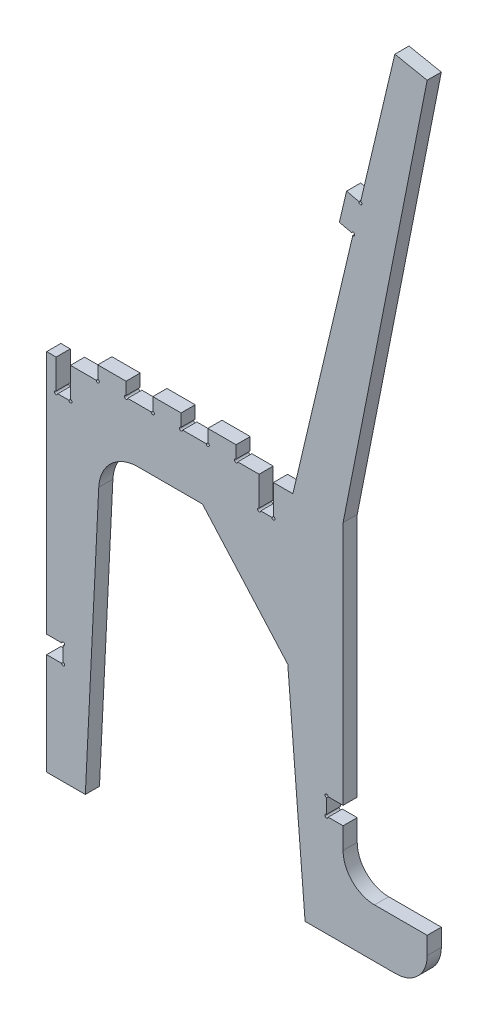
ISO-10303-21;
HEADER;
FILE_DESCRIPTION(('STEP AP214'),'2;1');
FILE_NAME('part.step','',(''),(''),'','','');
FILE_SCHEMA(('AUTOMOTIVE_DESIGN { 1 0 10303 214 1 1 1 1 }'));
ENDSEC;
DATA;
#1=APPLICATION_CONTEXT('core data for automotive mechanical design processes');
#2=APPLICATION_PROTOCOL_DEFINITION('international standard','automotive_design',2000,#1);
#3=PRODUCT_CONTEXT('',#1,'mechanical');
#4=PRODUCT('Part','Part','',(#3));
#5=PRODUCT_RELATED_PRODUCT_CATEGORY('part','',(#4));
#6=PRODUCT_DEFINITION_FORMATION('','',#4);
#7=PRODUCT_DEFINITION_CONTEXT('part definition',#1,'design');
#8=PRODUCT_DEFINITION('design','',#6,#7);
#9=PRODUCT_DEFINITION_SHAPE('','',#8);
#10=(LENGTH_UNIT() NAMED_UNIT(*) SI_UNIT(.MILLI.,.METRE.));
#11=(NAMED_UNIT(*) PLANE_ANGLE_UNIT() SI_UNIT($,.RADIAN.));
#12=(NAMED_UNIT(*) SI_UNIT($,.STERADIAN.) SOLID_ANGLE_UNIT());
#13=UNCERTAINTY_MEASURE_WITH_UNIT(LENGTH_MEASURE(1.E-05),#10,'distance_accuracy_value','');
#14=(GEOMETRIC_REPRESENTATION_CONTEXT(3) GLOBAL_UNCERTAINTY_ASSIGNED_CONTEXT((#13)) GLOBAL_UNIT_ASSIGNED_CONTEXT((#10,
#11,#12)) REPRESENTATION_CONTEXT('',''));
#15=CARTESIAN_POINT('',(0.,0.,0.));
#16=DIRECTION('',(0.,0.,1.));
#17=DIRECTION('',(1.,0.,0.));
#18=AXIS2_PLACEMENT_3D('',#15,#16,#17);
#19=CARTESIAN_POINT('',(346.86022039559,-338.10339306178,-26.5000000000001));
#20=DIRECTION('',(-1.,0.,0.));
#21=DIRECTION('',(0.,0.,1.));
#22=AXIS2_PLACEMENT_3D('',#19,#20,#21);
#23=PLANE('',#22);
#24=DIRECTION('',(0.,1.,0.));
#25=VECTOR('',#24,1.);
#26=CARTESIAN_POINT('',(346.86022039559,-338.10339306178,-26.5000000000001));
#27=LINE('',#26,#25);
#28=CARTESIAN_POINT('',(346.86022039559,-288.43087167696,-26.5000000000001));
#29=VERTEX_POINT('',#28);
#30=CARTESIAN_POINT('',(346.86022039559,22.9994443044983,-26.5000000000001));
#31=VERTEX_POINT('',#30);
#32=EDGE_CURVE('E582',#29,#31,#27,.T.);
#33=ORIENTED_EDGE('',*,*,#32,.F.);
#34=DIRECTION('',(0.,0.,1.));
#35=VECTOR('',#34,1.);
#36=CARTESIAN_POINT('',(346.86022039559,-288.43087167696,-26.5000000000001));
#37=LINE('',#36,#35);
#38=CARTESIAN_POINT('',(346.86022039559,-288.43087167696,-44.5000000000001));
#39=VERTEX_POINT('',#38);
#40=EDGE_CURVE('E933',#39,#29,#37,.T.);
#41=ORIENTED_EDGE('',*,*,#40,.F.);
#42=DIRECTION('',(0.,1.,0.));
#43=VECTOR('',#42,1.);
#44=CARTESIAN_POINT('',(346.86022039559,-338.10339306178,-44.5000000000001));
#45=LINE('',#44,#43);
#46=CARTESIAN_POINT('',(346.86022039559,22.9994443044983,-44.5000000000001));
#47=VERTEX_POINT('',#46);
#48=EDGE_CURVE('E628',#39,#47,#45,.T.);
#49=ORIENTED_EDGE('',*,*,#48,.T.);
#50=DIRECTION('',(0.,0.,-1.));
#51=VECTOR('',#50,1.);
#52=CARTESIAN_POINT('',(346.86022039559,22.9994443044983,-26.5000000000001));
#53=LINE('',#52,#51);
#54=EDGE_CURVE('E677',#31,#47,#53,.T.);
#55=ORIENTED_EDGE('',*,*,#54,.F.);
#56=EDGE_LOOP('',(#33,#41,#49,#55));
#57=FACE_BOUND('',#56,.T.);
#58=ADVANCED_FACE('F35',(#57),#23,.F.);
#59=CARTESIAN_POINT('',(-30.2551272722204,22.9994443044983,-26.5000000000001));
#60=DIRECTION('',(1.,0.,0.));
#61=DIRECTION('',(0.,0.,-1.));
#62=AXIS2_PLACEMENT_3D('',#59,#60,#61);
#63=PLANE('',#62);
#64=DIRECTION('',(0.,-1.,0.));
#65=VECTOR('',#64,1.);
#66=CARTESIAN_POINT('',(-30.2551272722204,22.9994443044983,-44.5000000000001));
#67=LINE('',#66,#65);
#68=CARTESIAN_POINT('',(-30.2551272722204,22.9994443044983,-44.5000000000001));
#69=VERTEX_POINT('',#68);
#70=CARTESIAN_POINT('',(-30.2551272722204,-288.43087167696,-44.5000000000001));
#71=VERTEX_POINT('',#70);
#72=EDGE_CURVE('E646',#69,#71,#67,.T.);
#73=ORIENTED_EDGE('',*,*,#72,.T.);
#74=DIRECTION('',(0.,0.,-1.));
#75=VECTOR('',#74,1.);
#76=CARTESIAN_POINT('',(-30.2551272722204,-288.43087167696,-44.7717889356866));
#77=LINE('',#76,#75);
#78=CARTESIAN_POINT('',(-30.2551272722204,-288.43087167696,-26.5000000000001));
#79=VERTEX_POINT('',#78);
#80=EDGE_CURVE('E729',#79,#71,#77,.T.);
#81=ORIENTED_EDGE('',*,*,#80,.F.);
#82=DIRECTION('',(0.,-1.,0.));
#83=VECTOR('',#82,1.);
#84=CARTESIAN_POINT('',(-30.2551272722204,22.9994443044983,-26.5000000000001));
#85=LINE('',#84,#83);
#86=CARTESIAN_POINT('',(-30.2551272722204,22.9994443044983,-26.5000000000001));
#87=VERTEX_POINT('',#86);
#88=EDGE_CURVE('E601',#87,#79,#85,.T.);
#89=ORIENTED_EDGE('',*,*,#88,.F.);
#90=DIRECTION('',(0.,0.,-1.));
#91=VECTOR('',#90,1.);
#92=CARTESIAN_POINT('',(-30.2551272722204,22.9994443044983,-26.5000000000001));
#93=LINE('',#92,#91);
#94=EDGE_CURVE('E665',#87,#69,#93,.T.);
#95=ORIENTED_EDGE('',*,*,#94,.T.);
#96=EDGE_LOOP('',(#73,#81,#89,#95));
#97=FACE_BOUND('',#96,.T.);
#98=ADVANCED_FACE('F956',(#97),#63,.F.);
#99=CARTESIAN_POINT('',(412.709341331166,572.19444079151,-26.5000000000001));
#100=DIRECTION('',(0.973224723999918,-0.229855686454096,0.));
#101=DIRECTION('',(0.229855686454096,0.973224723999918,0.));
#102=AXIS2_PLACEMENT_3D('',#99,#100,#101);
#103=PLANE('',#102);
#104=DIRECTION('',(-0.229855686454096,-0.973224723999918,0.));
#105=VECTOR('',#104,1.);
#106=CARTESIAN_POINT('',(412.709341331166,572.19444079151,-26.5000000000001));
#107=LINE('',#106,#105);
#108=CARTESIAN_POINT('',(359.198545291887,345.626064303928,-26.5000000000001));
#109=VERTEX_POINT('',#108);
#110=CARTESIAN_POINT('',(283.000765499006,22.9994443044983,-26.5000000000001));
#111=VERTEX_POINT('',#110);
#112=EDGE_CURVE('E590',#109,#111,#107,.T.);
#113=ORIENTED_EDGE('',*,*,#112,.F.);
#114=DIRECTION('',(0.,0.,1.));
#115=VECTOR('',#114,1.);
#116=CARTESIAN_POINT('',(359.198545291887,345.626064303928,-44.5010000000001));
#117=LINE('',#116,#115);
#118=CARTESIAN_POINT('',(359.198545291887,345.626064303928,-44.5000000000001));
#119=VERTEX_POINT('',#118);
#120=EDGE_CURVE('E813',#119,#109,#117,.T.);
#121=ORIENTED_EDGE('',*,*,#120,.F.);
#122=DIRECTION('',(-0.229855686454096,-0.973224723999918,0.));
#123=VECTOR('',#122,1.);
#124=CARTESIAN_POINT('',(412.709341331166,572.19444079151,-44.5000000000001));
#125=LINE('',#124,#123);
#126=CARTESIAN_POINT('',(283.000765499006,22.9994443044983,-44.5000000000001));
#127=VERTEX_POINT('',#126);
#128=EDGE_CURVE('E636',#119,#127,#125,.T.);
#129=ORIENTED_EDGE('',*,*,#128,.T.);
#130=DIRECTION('',(0.,0.,-1.));
#131=VECTOR('',#130,1.);
#132=CARTESIAN_POINT('',(283.000765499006,22.9994443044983,-26.5000000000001));
#133=LINE('',#132,#131);
#134=EDGE_CURVE('E668',#111,#127,#133,.T.);
#135=ORIENTED_EDGE('',*,*,#134,.F.);
#136=EDGE_LOOP('',(#113,#121,#129,#135));
#137=FACE_BOUND('',#136,.T.);
#138=ADVANCED_FACE('F1023',(#137),#103,.F.);
#139=CARTESIAN_POINT('',(283.000765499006,22.9994443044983,-26.5000000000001));
#140=DIRECTION('',(0.,-1.,0.));
#141=DIRECTION('',(0.,0.,-1.));
#142=AXIS2_PLACEMENT_3D('',#139,#140,#141);
#143=PLANE('',#142);
#144=DIRECTION('',(-1.,0.,0.));
#145=VECTOR('',#144,1.);
#146=CARTESIAN_POINT('',(283.000765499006,22.9994443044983,-44.5000000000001));
#147=LINE('',#146,#145);
#148=CARTESIAN_POINT('',(240.,22.9994443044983,-44.5));
#149=VERTEX_POINT('',#148);
#150=CARTESIAN_POINT('',(212.74487272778,22.9994443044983,-44.5000000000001));
#151=VERTEX_POINT('',#150);
#152=EDGE_CURVE('E645',#149,#151,#147,.T.);
#153=ORIENTED_EDGE('',*,*,#152,.T.);
#154=DIRECTION('',(0.,0.,1.));
#155=VECTOR('',#154,1.);
#156=CARTESIAN_POINT('',(212.74487272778,22.9994443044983,-44.5010000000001));
#157=LINE('',#156,#155);
#158=CARTESIAN_POINT('',(212.74487272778,22.9994443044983,-26.5000000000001));
#159=VERTEX_POINT('',#158);
#160=EDGE_CURVE('E799',#159,#151,#157,.F.);
#161=ORIENTED_EDGE('',*,*,#160,.F.);
#162=DIRECTION('',(-1.,0.,0.));
#163=VECTOR('',#162,1.);
#164=CARTESIAN_POINT('',(283.000765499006,22.9994443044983,-26.5000000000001));
#165=LINE('',#164,#163);
#166=CARTESIAN_POINT('',(240.,22.9994443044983,-26.5000000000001));
#167=VERTEX_POINT('',#166);
#168=EDGE_CURVE('E599',#167,#159,#165,.T.);
#169=ORIENTED_EDGE('',*,*,#168,.F.);
#170=DIRECTION('',(0.,0.,-1.));
#171=VECTOR('',#170,1.);
#172=CARTESIAN_POINT('',(240.,22.9994443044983,1399.19003059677));
#173=LINE('',#172,#171);
#174=EDGE_CURVE('E517',#167,#149,#173,.T.);
#175=ORIENTED_EDGE('',*,*,#174,.T.);
#176=EDGE_LOOP('',(#153,#161,#169,#175));
#177=FACE_BOUND('',#176,.T.);
#178=ADVANCED_FACE('F998',(#177),#143,.F.);
#179=CARTESIAN_POINT('',(172.74487272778,22.9994443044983,-26.5000000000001));
#180=VERTEX_POINT('',#179);
#181=CARTESIAN_POINT('',(142.74487272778,22.9994443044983,-26.5000000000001));
#182=VERTEX_POINT('',#181);
#183=EDGE_CURVE('E988',#180,#182,#165,.T.);
#184=ORIENTED_EDGE('',*,*,#183,.F.);
#185=DIRECTION('',(0.,0.,1.));
#186=VECTOR('',#185,1.);
#187=CARTESIAN_POINT('',(172.74487272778,22.9994443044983,-44.5010000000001));
#188=LINE('',#187,#186);
#189=CARTESIAN_POINT('',(172.74487272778,22.9994443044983,-44.5000000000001));
#190=VERTEX_POINT('',#189);
#191=EDGE_CURVE('E452',#190,#180,#188,.T.);
#192=ORIENTED_EDGE('',*,*,#191,.F.);
#193=CARTESIAN_POINT('',(142.74487272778,22.9994443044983,-44.5000000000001));
#194=VERTEX_POINT('',#193);
#195=EDGE_CURVE('E464',#190,#194,#147,.T.);
#196=ORIENTED_EDGE('',*,*,#195,.T.);
#197=DIRECTION('',(0.,0.,1.));
#198=VECTOR('',#197,1.);
#199=CARTESIAN_POINT('',(142.74487272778,22.9994443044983,-44.5010000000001));
#200=LINE('',#199,#198);
#201=EDGE_CURVE('E915',#182,#194,#200,.F.);
#202=ORIENTED_EDGE('',*,*,#201,.F.);
#203=EDGE_LOOP('',(#184,#192,#196,#202));
#204=FACE_BOUND('',#203,.T.);
#205=ADVANCED_FACE('F1181',(#204),#143,.F.);
#206=CARTESIAN_POINT('',(102.74487272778,22.9994443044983,-26.5000000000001));
#207=VERTEX_POINT('',#206);
#208=CARTESIAN_POINT('',(72.7448727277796,22.9994443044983,-26.5000000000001));
#209=VERTEX_POINT('',#208);
#210=EDGE_CURVE('E987',#207,#209,#165,.T.);
#211=ORIENTED_EDGE('',*,*,#210,.F.);
#212=DIRECTION('',(0.,0.,1.));
#213=VECTOR('',#212,1.);
#214=CARTESIAN_POINT('',(102.74487272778,22.9994443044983,-44.5010000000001));
#215=LINE('',#214,#213);
#216=CARTESIAN_POINT('',(102.74487272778,22.9994443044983,-44.5000000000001));
#217=VERTEX_POINT('',#216);
#218=EDGE_CURVE('E906',#217,#207,#215,.T.);
#219=ORIENTED_EDGE('',*,*,#218,.F.);
#220=CARTESIAN_POINT('',(72.7448727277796,22.9994443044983,-44.5000000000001));
#221=VERTEX_POINT('',#220);
#222=EDGE_CURVE('E963',#217,#221,#147,.T.);
#223=ORIENTED_EDGE('',*,*,#222,.T.);
#224=DIRECTION('',(0.,0.,1.));
#225=VECTOR('',#224,1.);
#226=CARTESIAN_POINT('',(72.7448727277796,22.9994443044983,-44.5010000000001));
#227=LINE('',#226,#225);
#228=EDGE_CURVE('E896',#209,#221,#227,.F.);
#229=ORIENTED_EDGE('',*,*,#228,.F.);
#230=EDGE_LOOP('',(#211,#219,#223,#229));
#231=FACE_BOUND('',#230,.T.);
#232=ADVANCED_FACE('F974',(#231),#143,.F.);
#233=CARTESIAN_POINT('',(258.2,22.9994443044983,-44.5000000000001));
#234=VERTEX_POINT('',#233);
#235=EDGE_CURVE('E641',#127,#234,#147,.T.);
#236=ORIENTED_EDGE('',*,*,#235,.T.);
#237=DIRECTION('',(0.,0.,-1.));
#238=VECTOR('',#237,1.);
#239=CARTESIAN_POINT('',(258.2,22.9994443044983,1399.19003059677));
#240=LINE('',#239,#238);
#241=CARTESIAN_POINT('',(258.2,22.9994443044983,-26.5000000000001));
#242=VERTEX_POINT('',#241);
#243=EDGE_CURVE('E529',#242,#234,#240,.T.);
#244=ORIENTED_EDGE('',*,*,#243,.F.);
#245=EDGE_CURVE('E595',#111,#242,#165,.T.);
#246=ORIENTED_EDGE('',*,*,#245,.F.);
#247=ORIENTED_EDGE('',*,*,#134,.T.);
#248=EDGE_LOOP('',(#236,#244,#246,#247));
#249=FACE_BOUND('',#248,.T.);
#250=ADVANCED_FACE('F1019',(#249),#143,.F.);
#251=CARTESIAN_POINT('',(32.7448727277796,22.9994443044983,-26.5000000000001));
#252=VERTEX_POINT('',#251);
#253=CARTESIAN_POINT('',(0.,22.9994443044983,-26.5000000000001));
#254=VERTEX_POINT('',#253);
#255=EDGE_CURVE('E600',#252,#254,#165,.T.);
#256=ORIENTED_EDGE('',*,*,#255,.F.);
#257=DIRECTION('',(0.,0.,1.));
#258=VECTOR('',#257,1.);
#259=CARTESIAN_POINT('',(32.7448727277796,22.9994443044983,-44.5010000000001));
#260=LINE('',#259,#258);
#261=CARTESIAN_POINT('',(32.7448727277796,22.9994443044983,-44.5000000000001));
#262=VERTEX_POINT('',#261);
#263=EDGE_CURVE('E886',#262,#252,#260,.T.);
#264=ORIENTED_EDGE('',*,*,#263,.F.);
#265=CARTESIAN_POINT('',(0.,22.9994443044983,-44.5000000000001));
#266=VERTEX_POINT('',#265);
#267=EDGE_CURVE('E962',#262,#266,#147,.T.);
#268=ORIENTED_EDGE('',*,*,#267,.T.);
#269=DIRECTION('',(0.,0.,-1.));
#270=VECTOR('',#269,1.);
#271=CARTESIAN_POINT('',(0.,22.9994443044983,-44.5010000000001));
#272=LINE('',#271,#270);
#273=EDGE_CURVE('E542',#254,#266,#272,.T.);
#274=ORIENTED_EDGE('',*,*,#273,.F.);
#275=EDGE_LOOP('',(#256,#264,#268,#274));
#276=FACE_BOUND('',#275,.T.);
#277=ADVANCED_FACE('F1165',(#276),#143,.F.);
#278=CARTESIAN_POINT('',(85.9391307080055,-45.8810523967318,-26.5000000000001));
#279=DIRECTION('',(0.,1.,0.));
#280=DIRECTION('',(-1.,0.,0.));
#281=AXIS2_PLACEMENT_3D('',#278,#279,#280);
#282=PLANE('',#281);
#283=DIRECTION('',(1.,0.,0.));
#284=VECTOR('',#283,1.);
#285=CARTESIAN_POINT('',(85.9391307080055,-45.8810523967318,-44.5000000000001));
#286=LINE('',#285,#284);
#287=CARTESIAN_POINT('',(85.9391307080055,-45.8810523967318,-44.5000000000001));
#288=VERTEX_POINT('',#287);
#289=CARTESIAN_POINT('',(167.959437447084,-45.8810523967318,-44.5000000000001));
#290=VERTEX_POINT('',#289);
#291=EDGE_CURVE('E563',#288,#290,#286,.T.);
#292=ORIENTED_EDGE('',*,*,#291,.T.);
#293=DIRECTION('',(0.,0.,-1.));
#294=VECTOR('',#293,1.);
#295=CARTESIAN_POINT('',(167.959437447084,-45.8810523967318,-26.5000000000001));
#296=LINE('',#295,#294);
#297=CARTESIAN_POINT('',(167.959437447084,-45.8810523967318,-26.5000000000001));
#298=VERTEX_POINT('',#297);
#299=EDGE_CURVE('E701',#298,#290,#296,.T.);
#300=ORIENTED_EDGE('',*,*,#299,.F.);
#301=DIRECTION('',(1.,0.,0.));
#302=VECTOR('',#301,1.);
#303=CARTESIAN_POINT('',(85.9391307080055,-45.8810523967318,-26.5000000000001));
#304=LINE('',#303,#302);
#305=CARTESIAN_POINT('',(85.9391307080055,-45.8810523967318,-26.5000000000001));
#306=VERTEX_POINT('',#305);
#307=EDGE_CURVE('E564',#306,#298,#304,.T.);
#308=ORIENTED_EDGE('',*,*,#307,.F.);
#309=DIRECTION('',(0.,0.,-1.));
#310=VECTOR('',#309,1.);
#311=CARTESIAN_POINT('',(85.9391307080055,-45.8810523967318,-26.5000000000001));
#312=LINE('',#311,#310);
#313=EDGE_CURVE('E610',#306,#288,#312,.T.);
#314=ORIENTED_EDGE('',*,*,#313,.T.);
#315=EDGE_LOOP('',(#292,#300,#308,#314));
#316=FACE_BOUND('',#315,.T.);
#317=ADVANCED_FACE('F37',(#316),#282,.F.);
#318=CARTESIAN_POINT('',(167.959437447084,-45.8810523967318,-26.5000000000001));
#319=DIRECTION('',(0.747809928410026,0.663912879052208,0.));
#320=DIRECTION('',(-0.663912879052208,0.747809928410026,0.));
#321=AXIS2_PLACEMENT_3D('',#318,#319,#320);
#322=PLANE('',#321);
#323=DIRECTION('',(0.663912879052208,-0.747809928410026,0.));
#324=VECTOR('',#323,1.);
#325=CARTESIAN_POINT('',(167.959437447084,-45.8810523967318,-44.5000000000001));
#326=LINE('',#325,#324);
#327=CARTESIAN_POINT('',(276.503019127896,-168.141021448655,-44.5000000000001));
#328=VERTEX_POINT('',#327);
#329=EDGE_CURVE('E613',#290,#328,#326,.T.);
#330=ORIENTED_EDGE('',*,*,#329,.T.);
#331=DIRECTION('',(0.,0.,-1.));
#332=VECTOR('',#331,1.);
#333=CARTESIAN_POINT('',(276.503019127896,-168.141021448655,-26.5000000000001));
#334=LINE('',#333,#332);
#335=CARTESIAN_POINT('',(276.503019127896,-168.141021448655,-26.5000000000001));
#336=VERTEX_POINT('',#335);
#337=EDGE_CURVE('E698',#336,#328,#334,.T.);
#338=ORIENTED_EDGE('',*,*,#337,.F.);
#339=DIRECTION('',(0.663912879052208,-0.747809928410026,0.));
#340=VECTOR('',#339,1.);
#341=CARTESIAN_POINT('',(167.959437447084,-45.8810523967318,-26.5000000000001));
#342=LINE('',#341,#340);
#343=EDGE_CURVE('E567',#298,#336,#342,.T.);
#344=ORIENTED_EDGE('',*,*,#343,.F.);
#345=ORIENTED_EDGE('',*,*,#299,.T.);
#346=EDGE_LOOP('',(#330,#338,#344,#345));
#347=FACE_BOUND('',#346,.T.);
#348=ADVANCED_FACE('F1122',(#347),#322,.F.);
#349=CARTESIAN_POINT('',(276.503019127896,-168.141021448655,-26.5000000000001));
#350=DIRECTION('',(0.996742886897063,0.080645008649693,0.));
#351=DIRECTION('',(-0.0806450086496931,0.996742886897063,0.));
#352=AXIS2_PLACEMENT_3D('',#349,#350,#351);
#353=PLANE('',#352);
#354=DIRECTION('',(0.0806450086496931,-0.996742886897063,0.));
#355=VECTOR('',#354,1.);
#356=CARTESIAN_POINT('',(276.503019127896,-168.141021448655,-44.5000000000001));
#357=LINE('',#356,#355);
#358=CARTESIAN_POINT('',(298.534146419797,-440.437717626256,-44.5000000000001));
#359=VERTEX_POINT('',#358);
#360=EDGE_CURVE('E615',#328,#359,#357,.T.);
#361=ORIENTED_EDGE('',*,*,#360,.T.);
#362=DIRECTION('',(0.,0.,-1.));
#363=VECTOR('',#362,1.);
#364=CARTESIAN_POINT('',(298.534146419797,-440.437717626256,-26.5000000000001));
#365=LINE('',#364,#363);
#366=CARTESIAN_POINT('',(298.534146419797,-440.437717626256,-26.5000000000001));
#367=VERTEX_POINT('',#366);
#368=EDGE_CURVE('E695',#367,#359,#365,.T.);
#369=ORIENTED_EDGE('',*,*,#368,.F.);
#370=DIRECTION('',(0.0806450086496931,-0.996742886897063,0.));
#371=VECTOR('',#370,1.);
#372=CARTESIAN_POINT('',(276.503019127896,-168.141021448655,-26.5000000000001));
#373=LINE('',#372,#371);
#374=EDGE_CURVE('E570',#336,#367,#373,.T.);
#375=ORIENTED_EDGE('',*,*,#374,.F.);
#376=ORIENTED_EDGE('',*,*,#337,.T.);
#377=EDGE_LOOP('',(#361,#369,#375,#376));
#378=FACE_BOUND('',#377,.T.);
#379=ADVANCED_FACE('F1117',(#378),#353,.F.);
#380=CARTESIAN_POINT('',(413.867955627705,-440.437717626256,-26.5000000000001));
#381=DIRECTION('',(0.,1.,0.));
#382=DIRECTION('',(0.,0.,1.));
#383=AXIS2_PLACEMENT_3D('',#380,#381,#382);
#384=PLANE('',#383);
#385=DIRECTION('',(1.,0.,0.));
#386=VECTOR('',#385,1.);
#387=CARTESIAN_POINT('',(413.867955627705,-440.437717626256,-44.5000000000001));
#388=LINE('',#387,#386);
#389=CARTESIAN_POINT('',(413.867955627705,-440.437717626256,-44.5000000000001));
#390=VERTEX_POINT('',#389);
#391=EDGE_CURVE('E618',#359,#390,#388,.T.);
#392=ORIENTED_EDGE('',*,*,#391,.T.);
#393=DIRECTION('',(0.,0.,-1.));
#394=VECTOR('',#393,1.);
#395=CARTESIAN_POINT('',(413.867955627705,-440.437717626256,-26.5000000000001));
#396=LINE('',#395,#394);
#397=CARTESIAN_POINT('',(413.867955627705,-440.437717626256,-26.5000000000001));
#398=VERTEX_POINT('',#397);
#399=EDGE_CURVE('E692',#398,#390,#396,.T.);
#400=ORIENTED_EDGE('',*,*,#399,.F.);
#401=DIRECTION('',(1.,0.,0.));
#402=VECTOR('',#401,1.);
#403=CARTESIAN_POINT('',(298.534146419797,-440.437717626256,-26.5000000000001));
#404=LINE('',#403,#402);
#405=EDGE_CURVE('E572',#367,#398,#404,.T.);
#406=ORIENTED_EDGE('',*,*,#405,.F.);
#407=ORIENTED_EDGE('',*,*,#368,.T.);
#408=EDGE_LOOP('',(#392,#400,#406,#407));
#409=FACE_BOUND('',#408,.T.);
#410=ADVANCED_FACE('F1113',(#409),#384,.F.);
#411=CARTESIAN_POINT('',(413.867955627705,-400.437717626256,-26.5000000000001));
#412=DIRECTION('',(0.,0.,-1.));
#413=DIRECTION('',(-1.,0.,0.));
#414=AXIS2_PLACEMENT_3D('',#411,#412,#413);
#415=CYLINDRICAL_SURFACE('',#414,40.);
#416=CARTESIAN_POINT('',(413.867955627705,-400.437717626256,-44.5000000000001));
#417=DIRECTION('',(0.,0.,1.));
#418=DIRECTION('',(-1.,0.,0.));
#419=AXIS2_PLACEMENT_3D('',#416,#417,#418);
#420=CIRCLE('',#419,40.);
#421=CARTESIAN_POINT('',(453.867955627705,-400.437717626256,-44.5000000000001));
#422=VERTEX_POINT('',#421);
#423=EDGE_CURVE('E620',#390,#422,#420,.T.);
#424=ORIENTED_EDGE('',*,*,#423,.T.);
#425=DIRECTION('',(0.,0.,-1.));
#426=VECTOR('',#425,1.);
#427=CARTESIAN_POINT('',(453.867955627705,-400.437717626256,-26.5000000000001));
#428=LINE('',#427,#426);
#429=CARTESIAN_POINT('',(453.867955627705,-400.437717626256,-26.5000000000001));
#430=VERTEX_POINT('',#429);
#431=EDGE_CURVE('E689',#430,#422,#428,.T.);
#432=ORIENTED_EDGE('',*,*,#431,.F.);
#433=CARTESIAN_POINT('',(413.867955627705,-400.437717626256,-26.5000000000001));
#434=DIRECTION('',(0.,0.,1.));
#435=DIRECTION('',(-1.,0.,0.));
#436=AXIS2_PLACEMENT_3D('',#433,#434,#435);
#437=CIRCLE('',#436,40.);
#438=EDGE_CURVE('E574',#398,#430,#437,.T.);
#439=ORIENTED_EDGE('',*,*,#438,.F.);
#440=ORIENTED_EDGE('',*,*,#399,.T.);
#441=EDGE_LOOP('',(#424,#432,#439,#440));
#442=FACE_BOUND('',#441,.T.);
#443=ADVANCED_FACE('F1108',(#442),#415,.T.);
#444=CARTESIAN_POINT('',(453.867955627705,-378.10339306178,-26.5000000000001));
#445=DIRECTION('',(-1.,0.,0.));
#446=DIRECTION('',(0.,0.,1.));
#447=AXIS2_PLACEMENT_3D('',#444,#445,#446);
#448=PLANE('',#447);
#449=DIRECTION('',(0.,1.,0.));
#450=VECTOR('',#449,1.);
#451=CARTESIAN_POINT('',(453.867955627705,-378.10339306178,-44.5000000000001));
#452=LINE('',#451,#450);
#453=CARTESIAN_POINT('',(453.867955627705,-378.10339306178,-44.5000000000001));
#454=VERTEX_POINT('',#453);
#455=EDGE_CURVE('E622',#422,#454,#452,.T.);
#456=ORIENTED_EDGE('',*,*,#455,.T.);
#457=DIRECTION('',(0.,0.,-1.));
#458=VECTOR('',#457,1.);
#459=CARTESIAN_POINT('',(453.867955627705,-378.10339306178,-26.5000000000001));
#460=LINE('',#459,#458);
#461=CARTESIAN_POINT('',(453.867955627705,-378.10339306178,-26.5000000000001));
#462=VERTEX_POINT('',#461);
#463=EDGE_CURVE('E686',#462,#454,#460,.T.);
#464=ORIENTED_EDGE('',*,*,#463,.F.);
#465=DIRECTION('',(0.,1.,0.));
#466=VECTOR('',#465,1.);
#467=CARTESIAN_POINT('',(453.867955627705,-378.10339306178,-26.5000000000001));
#468=LINE('',#467,#466);
#469=EDGE_CURVE('E576',#430,#462,#468,.T.);
#470=ORIENTED_EDGE('',*,*,#469,.F.);
#471=ORIENTED_EDGE('',*,*,#431,.T.);
#472=EDGE_LOOP('',(#456,#464,#470,#471));
#473=FACE_BOUND('',#472,.T.);
#474=ADVANCED_FACE('F1103',(#473),#448,.F.);
#475=CARTESIAN_POINT('',(386.86022039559,-378.10339306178,-26.5000000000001));
#476=DIRECTION('',(0.,-1.,0.));
#477=DIRECTION('',(0.,0.,-1.));
#478=AXIS2_PLACEMENT_3D('',#475,#476,#477);
#479=PLANE('',#478);
#480=DIRECTION('',(-1.,0.,0.));
#481=VECTOR('',#480,1.);
#482=CARTESIAN_POINT('',(386.86022039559,-378.10339306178,-44.5000000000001));
#483=LINE('',#482,#481);
#484=CARTESIAN_POINT('',(386.86022039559,-378.10339306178,-44.5000000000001));
#485=VERTEX_POINT('',#484);
#486=EDGE_CURVE('E624',#454,#485,#483,.T.);
#487=ORIENTED_EDGE('',*,*,#486,.T.);
#488=DIRECTION('',(0.,0.,-1.));
#489=VECTOR('',#488,1.);
#490=CARTESIAN_POINT('',(386.86022039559,-378.10339306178,-26.5000000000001));
#491=LINE('',#490,#489);
#492=CARTESIAN_POINT('',(386.86022039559,-378.10339306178,-26.5000000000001));
#493=VERTEX_POINT('',#492);
#494=EDGE_CURVE('E683',#493,#485,#491,.T.);
#495=ORIENTED_EDGE('',*,*,#494,.F.);
#496=DIRECTION('',(-1.,0.,0.));
#497=VECTOR('',#496,1.);
#498=CARTESIAN_POINT('',(386.86022039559,-378.10339306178,-26.5000000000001));
#499=LINE('',#498,#497);
#500=EDGE_CURVE('E578',#462,#493,#499,.T.);
#501=ORIENTED_EDGE('',*,*,#500,.F.);
#502=ORIENTED_EDGE('',*,*,#463,.T.);
#503=EDGE_LOOP('',(#487,#495,#501,#502));
#504=FACE_BOUND('',#503,.T.);
#505=ADVANCED_FACE('F1099',(#504),#479,.F.);
#506=CARTESIAN_POINT('',(386.86022039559,-338.10339306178,-26.5000000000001));
#507=DIRECTION('',(0.,0.,-1.));
#508=DIRECTION('',(-1.,0.,0.));
#509=AXIS2_PLACEMENT_3D('',#506,#507,#508);
#510=CYLINDRICAL_SURFACE('',#509,40.);
#511=CARTESIAN_POINT('',(386.86022039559,-338.10339306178,-44.5000000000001));
#512=DIRECTION('',(0.,0.,-1.));
#513=DIRECTION('',(-1.,0.,0.));
#514=AXIS2_PLACEMENT_3D('',#511,#512,#513);
#515=CIRCLE('',#514,40.);
#516=CARTESIAN_POINT('',(346.86022039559,-338.10339306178,-44.5000000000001));
#517=VERTEX_POINT('',#516);
#518=EDGE_CURVE('E626',#485,#517,#515,.T.);
#519=ORIENTED_EDGE('',*,*,#518,.T.);
#520=DIRECTION('',(0.,0.,-1.));
#521=VECTOR('',#520,1.);
#522=CARTESIAN_POINT('',(346.86022039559,-338.10339306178,-26.5000000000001));
#523=LINE('',#522,#521);
#524=CARTESIAN_POINT('',(346.86022039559,-338.10339306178,-26.5000000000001));
#525=VERTEX_POINT('',#524);
#526=EDGE_CURVE('E680',#525,#517,#523,.T.);
#527=ORIENTED_EDGE('',*,*,#526,.F.);
#528=CARTESIAN_POINT('',(386.86022039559,-338.10339306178,-26.5000000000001));
#529=DIRECTION('',(0.,0.,-1.));
#530=DIRECTION('',(-1.,0.,0.));
#531=AXIS2_PLACEMENT_3D('',#528,#529,#530);
#532=CIRCLE('',#531,40.);
#533=EDGE_CURVE('E580',#493,#525,#532,.T.);
#534=ORIENTED_EDGE('',*,*,#533,.F.);
#535=ORIENTED_EDGE('',*,*,#494,.T.);
#536=EDGE_LOOP('',(#519,#527,#534,#535));
#537=FACE_BOUND('',#536,.T.);
#538=ADVANCED_FACE('F1094',(#537),#510,.F.);
#539=CARTESIAN_POINT('',(346.86022039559,-310.93087167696,-44.5000000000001));
#540=VERTEX_POINT('',#539);
#541=EDGE_CURVE('E629',#517,#540,#45,.T.);
#542=ORIENTED_EDGE('',*,*,#541,.T.);
#543=DIRECTION('',(0.,0.,-1.));
#544=VECTOR('',#543,1.);
#545=CARTESIAN_POINT('',(346.86022039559,-310.93087167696,-44.5000000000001));
#546=LINE('',#545,#544);
#547=CARTESIAN_POINT('',(346.86022039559,-310.93087167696,-26.5000000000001));
#548=VERTEX_POINT('',#547);
#549=EDGE_CURVE('E928',#548,#540,#546,.T.);
#550=ORIENTED_EDGE('',*,*,#549,.F.);
#551=EDGE_CURVE('E583',#525,#548,#27,.T.);
#552=ORIENTED_EDGE('',*,*,#551,.F.);
#553=ORIENTED_EDGE('',*,*,#526,.T.);
#554=EDGE_LOOP('',(#542,#550,#552,#553));
#555=FACE_BOUND('',#554,.T.);
#556=ADVANCED_FACE('F1088',(#555),#23,.F.);
#557=CARTESIAN_POINT('',(346.86022039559,22.9994443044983,-26.5000000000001));
#558=DIRECTION('',(-0.980997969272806,0.194017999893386,0.));
#559=DIRECTION('',(-0.194017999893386,-0.980997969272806,0.));
#560=AXIS2_PLACEMENT_3D('',#557,#558,#559);
#561=PLANE('',#560);
#562=DIRECTION('',(0.194017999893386,0.980997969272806,0.));
#563=VECTOR('',#562,1.);
#564=CARTESIAN_POINT('',(346.86022039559,22.9994443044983,-44.5000000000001));
#565=LINE('',#564,#563);
#566=CARTESIAN_POINT('',(453.867955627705,564.054248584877,-44.5000000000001));
#567=VERTEX_POINT('',#566);
#568=EDGE_CURVE('E632',#47,#567,#565,.T.);
#569=ORIENTED_EDGE('',*,*,#568,.T.);
#570=DIRECTION('',(0.,0.,-1.));
#571=VECTOR('',#570,1.);
#572=CARTESIAN_POINT('',(453.867955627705,564.054248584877,-26.5000000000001));
#573=LINE('',#572,#571);
#574=CARTESIAN_POINT('',(453.867955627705,564.054248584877,-26.5000000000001));
#575=VERTEX_POINT('',#574);
#576=EDGE_CURVE('E674',#575,#567,#573,.T.);
#577=ORIENTED_EDGE('',*,*,#576,.F.);
#578=DIRECTION('',(0.194017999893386,0.980997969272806,0.));
#579=VECTOR('',#578,1.);
#580=CARTESIAN_POINT('',(346.86022039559,22.9994443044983,-26.5000000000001));
#581=LINE('',#580,#579);
#582=EDGE_CURVE('E586',#31,#575,#581,.T.);
#583=ORIENTED_EDGE('',*,*,#582,.F.);
#584=ORIENTED_EDGE('',*,*,#54,.T.);
#585=EDGE_LOOP('',(#569,#577,#583,#584));
#586=FACE_BOUND('',#585,.T.);
#587=ADVANCED_FACE('F1059',(#586),#561,.F.);
#588=CARTESIAN_POINT('',(453.867955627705,564.054248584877,-26.5000000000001));
#589=DIRECTION('',(-0.194017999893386,-0.980997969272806,0.));
#590=DIRECTION('',(0.980997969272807,-0.194017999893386,0.));
#591=AXIS2_PLACEMENT_3D('',#588,#589,#590);
#592=PLANE('',#591);
#593=DIRECTION('',(-0.980997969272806,0.194017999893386,0.));
#594=VECTOR('',#593,1.);
#595=CARTESIAN_POINT('',(453.867955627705,564.054248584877,-44.5000000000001));
#596=LINE('',#595,#594);
#597=CARTESIAN_POINT('',(412.709341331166,572.19444079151,-44.5000000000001));
#598=VERTEX_POINT('',#597);
#599=EDGE_CURVE('E634',#567,#598,#596,.T.);
#600=ORIENTED_EDGE('',*,*,#599,.T.);
#601=DIRECTION('',(0.,0.,-1.));
#602=VECTOR('',#601,1.);
#603=CARTESIAN_POINT('',(412.709341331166,572.19444079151,-26.5000000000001));
#604=LINE('',#603,#602);
#605=CARTESIAN_POINT('',(412.709341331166,572.19444079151,-26.5000000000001));
#606=VERTEX_POINT('',#605);
#607=EDGE_CURVE('E671',#606,#598,#604,.T.);
#608=ORIENTED_EDGE('',*,*,#607,.F.);
#609=DIRECTION('',(-0.980997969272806,0.194017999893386,0.));
#610=VECTOR('',#609,1.);
#611=CARTESIAN_POINT('',(453.867955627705,564.054248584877,-26.5000000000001));
#612=LINE('',#611,#610);
#613=EDGE_CURVE('E588',#575,#606,#612,.T.);
#614=ORIENTED_EDGE('',*,*,#613,.F.);
#615=ORIENTED_EDGE('',*,*,#576,.T.);
#616=EDGE_LOOP('',(#600,#608,#614,#615));
#617=FACE_BOUND('',#616,.T.);
#618=ADVANCED_FACE('F1055',(#617),#592,.F.);
#619=CARTESIAN_POINT('',(369.312195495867,388.447952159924,-44.5000000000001));
#620=VERTEX_POINT('',#619);
#621=EDGE_CURVE('E637',#598,#620,#125,.T.);
#622=ORIENTED_EDGE('',*,*,#621,.T.);
#623=DIRECTION('',(0.,0.,1.));
#624=VECTOR('',#623,1.);
#625=CARTESIAN_POINT('',(369.312195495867,388.447952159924,-44.5010000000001));
#626=LINE('',#625,#624);
#627=CARTESIAN_POINT('',(369.312195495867,388.447952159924,-26.5000000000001));
#628=VERTEX_POINT('',#627);
#629=EDGE_CURVE('E820',#628,#620,#626,.F.);
#630=ORIENTED_EDGE('',*,*,#629,.F.);
#631=EDGE_CURVE('E591',#606,#628,#107,.T.);
#632=ORIENTED_EDGE('',*,*,#631,.F.);
#633=ORIENTED_EDGE('',*,*,#607,.T.);
#634=EDGE_LOOP('',(#622,#630,#632,#633));
#635=FACE_BOUND('',#634,.T.);
#636=ADVANCED_FACE('F1050',(#635),#103,.F.);
#637=CARTESIAN_POINT('',(-18.2,22.9994443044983,-26.5000000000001));
#638=VERTEX_POINT('',#637);
#639=EDGE_CURVE('E594',#638,#87,#165,.T.);
#640=ORIENTED_EDGE('',*,*,#639,.F.);
#641=DIRECTION('',(0.,0.,1.));
#642=VECTOR('',#641,1.);
#643=CARTESIAN_POINT('',(-18.2,22.9994443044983,-44.5010000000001));
#644=LINE('',#643,#642);
#645=CARTESIAN_POINT('',(-18.2,22.9994443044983,-44.5000000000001));
#646=VERTEX_POINT('',#645);
#647=EDGE_CURVE('E540',#646,#638,#644,.T.);
#648=ORIENTED_EDGE('',*,*,#647,.F.);
#649=EDGE_CURVE('E640',#646,#69,#147,.T.);
#650=ORIENTED_EDGE('',*,*,#649,.T.);
#651=ORIENTED_EDGE('',*,*,#94,.F.);
#652=EDGE_LOOP('',(#640,#648,#650,#651));
#653=FACE_BOUND('',#652,.T.);
#654=ADVANCED_FACE('F960',(#653),#143,.F.);
#655=CARTESIAN_POINT('',(-30.2551272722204,-310.93087167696,-26.5000000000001));
#656=VERTEX_POINT('',#655);
#657=CARTESIAN_POINT('',(-30.2551272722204,-440.437717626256,-26.5000000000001));
#658=VERTEX_POINT('',#657);
#659=EDGE_CURVE('E598',#656,#658,#85,.T.);
#660=ORIENTED_EDGE('',*,*,#659,.F.);
#661=DIRECTION('',(0.,0.,1.));
#662=VECTOR('',#661,1.);
#663=CARTESIAN_POINT('',(-30.2551272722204,-310.93087167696,-26.2717889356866));
#664=LINE('',#663,#662);
#665=CARTESIAN_POINT('',(-30.2551272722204,-310.93087167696,-44.5000000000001));
#666=VERTEX_POINT('',#665);
#667=EDGE_CURVE('E721',#666,#656,#664,.T.);
#668=ORIENTED_EDGE('',*,*,#667,.F.);
#669=CARTESIAN_POINT('',(-30.2551272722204,-440.437717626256,-44.5000000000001));
#670=VERTEX_POINT('',#669);
#671=EDGE_CURVE('E644',#666,#670,#67,.T.);
#672=ORIENTED_EDGE('',*,*,#671,.T.);
#673=DIRECTION('',(0.,0.,-1.));
#674=VECTOR('',#673,1.);
#675=CARTESIAN_POINT('',(-30.2551272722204,-440.437717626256,-26.5000000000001));
#676=LINE('',#675,#674);
#677=EDGE_CURVE('E662',#658,#670,#676,.T.);
#678=ORIENTED_EDGE('',*,*,#677,.F.);
#679=EDGE_LOOP('',(#660,#668,#672,#678));
#680=FACE_BOUND('',#679,.T.);
#681=ADVANCED_FACE('F727',(#680),#63,.F.);
#682=CARTESIAN_POINT('',(-30.2551272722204,-440.437717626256,-26.5000000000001));
#683=DIRECTION('',(0.,1.,0.));
#684=DIRECTION('',(0.,0.,1.));
#685=AXIS2_PLACEMENT_3D('',#682,#683,#684);
#686=PLANE('',#685);
#687=DIRECTION('',(1.,0.,0.));
#688=VECTOR('',#687,1.);
#689=CARTESIAN_POINT('',(-30.2551272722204,-440.437717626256,-44.5000000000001));
#690=LINE('',#689,#688);
#691=CARTESIAN_POINT('',(18.9332898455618,-440.437717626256,-44.5000000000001));
#692=VERTEX_POINT('',#691);
#693=EDGE_CURVE('E649',#670,#692,#690,.T.);
#694=ORIENTED_EDGE('',*,*,#693,.T.);
#695=DIRECTION('',(0.,0.,-1.));
#696=VECTOR('',#695,1.);
#697=CARTESIAN_POINT('',(18.9332898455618,-440.437717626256,-26.5000000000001));
#698=LINE('',#697,#696);
#699=CARTESIAN_POINT('',(18.9332898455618,-440.437717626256,-26.5000000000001));
#700=VERTEX_POINT('',#699);
#701=EDGE_CURVE('E659',#700,#692,#698,.T.);
#702=ORIENTED_EDGE('',*,*,#701,.F.);
#703=DIRECTION('',(1.,0.,0.));
#704=VECTOR('',#703,1.);
#705=CARTESIAN_POINT('',(-30.2551272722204,-440.437717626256,-26.5000000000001));
#706=LINE('',#705,#704);
#707=EDGE_CURVE('E604',#658,#700,#706,.T.);
#708=ORIENTED_EDGE('',*,*,#707,.F.);
#709=ORIENTED_EDGE('',*,*,#677,.T.);
#710=EDGE_LOOP('',(#694,#702,#708,#709));
#711=FACE_BOUND('',#710,.T.);
#712=ADVANCED_FACE('F737',(#711),#686,.F.);
#713=CARTESIAN_POINT('',(18.9332898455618,-440.437717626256,-26.5000000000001));
#714=DIRECTION('',(-0.998792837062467,0.0491209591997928,0.));
#715=DIRECTION('',(-0.0491209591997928,-0.998792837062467,0.));
#716=AXIS2_PLACEMENT_3D('',#713,#714,#715);
#717=PLANE('',#716);
#718=DIRECTION('',(0.0491209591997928,0.998792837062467,0.));
#719=VECTOR('',#718,1.);
#720=CARTESIAN_POINT('',(18.9332898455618,-440.437717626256,-44.5000000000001));
#721=LINE('',#720,#719);
#722=CARTESIAN_POINT('',(35.9994888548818,-93.4250044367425,-44.5000000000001));
#723=VERTEX_POINT('',#722);
#724=EDGE_CURVE('E651',#692,#723,#721,.T.);
#725=ORIENTED_EDGE('',*,*,#724,.T.);
#726=DIRECTION('',(0.,0.,-1.));
#727=VECTOR('',#726,1.);
#728=CARTESIAN_POINT('',(35.9994888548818,-93.4250044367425,-26.5000000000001));
#729=LINE('',#728,#727);
#730=CARTESIAN_POINT('',(35.9994888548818,-93.4250044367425,-26.5000000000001));
#731=VERTEX_POINT('',#730);
#732=EDGE_CURVE('E656',#731,#723,#729,.T.);
#733=ORIENTED_EDGE('',*,*,#732,.F.);
#734=DIRECTION('',(0.0491209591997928,0.998792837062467,0.));
#735=VECTOR('',#734,1.);
#736=CARTESIAN_POINT('',(18.9332898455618,-440.437717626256,-26.5000000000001));
#737=LINE('',#736,#735);
#738=EDGE_CURVE('E606',#700,#731,#737,.T.);
#739=ORIENTED_EDGE('',*,*,#738,.F.);
#740=ORIENTED_EDGE('',*,*,#701,.T.);
#741=EDGE_LOOP('',(#725,#733,#739,#740));
#742=FACE_BOUND('',#741,.T.);
#743=ADVANCED_FACE('F741',(#742),#717,.F.);
#744=CARTESIAN_POINT('',(85.9391307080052,-95.8810523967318,-26.5000000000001));
#745=DIRECTION('',(0.,0.,-1.));
#746=DIRECTION('',(-1.,0.,0.));
#747=AXIS2_PLACEMENT_3D('',#744,#745,#746);
#748=CYLINDRICAL_SURFACE('',#747,50.);
#749=CARTESIAN_POINT('',(85.9391307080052,-95.8810523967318,-44.5000000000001));
#750=DIRECTION('',(0.,0.,-1.));
#751=DIRECTION('',(-1.,0.,0.));
#752=AXIS2_PLACEMENT_3D('',#749,#750,#751);
#753=CIRCLE('',#752,50.);
#754=EDGE_CURVE('E568',#723,#288,#753,.T.);
#755=ORIENTED_EDGE('',*,*,#754,.T.);
#756=ORIENTED_EDGE('',*,*,#313,.F.);
#757=CARTESIAN_POINT('',(85.9391307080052,-95.8810523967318,-26.5000000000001));
#758=DIRECTION('',(0.,0.,-1.));
#759=DIRECTION('',(-1.,0.,0.));
#760=AXIS2_PLACEMENT_3D('',#757,#758,#759);
#761=CIRCLE('',#760,50.);
#762=EDGE_CURVE('E608',#731,#306,#761,.T.);
#763=ORIENTED_EDGE('',*,*,#762,.F.);
#764=ORIENTED_EDGE('',*,*,#732,.T.);
#765=EDGE_LOOP('',(#755,#756,#763,#764));
#766=FACE_BOUND('',#765,.T.);
#767=ADVANCED_FACE('F1126',(#766),#748,.F.);
#768=CARTESIAN_POINT('',(413.867955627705,-400.437717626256,-26.5000000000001));
#769=DIRECTION('',(0.,0.,-1.));
#770=DIRECTION('',(-1.,0.,0.));
#771=AXIS2_PLACEMENT_3D('',#768,#769,#770);
#772=PLANE('',#771);
#773=DIRECTION('',(1.,0.,0.));
#774=VECTOR('',#773,1.);
#775=CARTESIAN_POINT('',(325.86022039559,-310.93087167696,-26.5000000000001));
#776=LINE('',#775,#774);
#777=CARTESIAN_POINT('',(327.86022039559,-310.93087167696,-26.5000000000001));
#778=VERTEX_POINT('',#777);
#779=EDGE_CURVE('E936',#778,#548,#776,.T.);
#780=ORIENTED_EDGE('',*,*,#779,.F.);
#781=CARTESIAN_POINT('',(325.86022039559,-310.93087167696,-26.5000000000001));
#782=DIRECTION('',(0.,0.,1.));
#783=DIRECTION('',(1.,0.,0.));
#784=AXIS2_PLACEMENT_3D('',#781,#782,#783);
#785=CIRCLE('',#784,2.);
#786=CARTESIAN_POINT('',(325.86022039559,-308.93087167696,-26.5000000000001));
#787=VERTEX_POINT('',#786);
#788=EDGE_CURVE('E855',#787,#778,#785,.T.);
#789=ORIENTED_EDGE('',*,*,#788,.F.);
#790=DIRECTION('',(0.,-1.,0.));
#791=VECTOR('',#790,1.);
#792=CARTESIAN_POINT('',(325.86022039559,-310.93087167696,-26.5000000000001));
#793=LINE('',#792,#791);
#794=CARTESIAN_POINT('',(325.86022039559,-290.43087167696,-26.5000000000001));
#795=VERTEX_POINT('',#794);
#796=EDGE_CURVE('E929',#795,#787,#793,.T.);
#797=ORIENTED_EDGE('',*,*,#796,.F.);
#798=CARTESIAN_POINT('',(325.86022039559,-288.43087167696,-26.5000000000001));
#799=DIRECTION('',(0.,0.,1.));
#800=DIRECTION('',(1.,0.,0.));
#801=AXIS2_PLACEMENT_3D('',#798,#799,#800);
#802=CIRCLE('',#801,2.);
#803=CARTESIAN_POINT('',(327.86022039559,-288.43087167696,-26.5000000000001));
#804=VERTEX_POINT('',#803);
#805=EDGE_CURVE('E847',#804,#795,#802,.T.);
#806=ORIENTED_EDGE('',*,*,#805,.F.);
#807=DIRECTION('',(1.,0.,0.));
#808=VECTOR('',#807,1.);
#809=CARTESIAN_POINT('',(325.86022039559,-288.43087167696,-26.5000000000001));
#810=LINE('',#809,#808);
#811=EDGE_CURVE('E730',#804,#29,#810,.T.);
#812=ORIENTED_EDGE('',*,*,#811,.T.);
#813=ORIENTED_EDGE('',*,*,#32,.T.);
#814=ORIENTED_EDGE('',*,*,#582,.T.);
#815=ORIENTED_EDGE('',*,*,#613,.T.);
#816=ORIENTED_EDGE('',*,*,#631,.T.);
#817=CARTESIAN_POINT('',(368.852484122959,386.501502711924,-26.5000000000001));
#818=DIRECTION('',(0.,0.,1.));
#819=DIRECTION('',(1.,0.,0.));
#820=AXIS2_PLACEMENT_3D('',#817,#818,#819);
#821=CIRCLE('',#820,2.);
#822=CARTESIAN_POINT('',(366.906034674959,386.961214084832,-26.5000000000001));
#823=VERTEX_POINT('',#822);
#824=EDGE_CURVE('E823',#823,#628,#821,.T.);
#825=ORIENTED_EDGE('',*,*,#824,.F.);
#826=DIRECTION('',(-0.973224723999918,0.229855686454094,0.));
#827=VECTOR('',#826,1.);
#828=CARTESIAN_POINT('',(368.852484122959,386.501502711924,-26.5000000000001));
#829=LINE('',#828,#827);
#830=CARTESIAN_POINT('',(351.334439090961,390.638905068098,-26.5000000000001));
#831=VERTEX_POINT('',#830);
#832=EDGE_CURVE('E763',#823,#831,#829,.T.);
#833=ORIENTED_EDGE('',*,*,#832,.T.);
#834=DIRECTION('',(0.229855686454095,0.973224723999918,0.));
#835=VECTOR('',#834,1.);
#836=CARTESIAN_POINT('',(342.140211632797,351.709916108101,-26.5000000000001));
#837=LINE('',#836,#835);
#838=CARTESIAN_POINT('',(342.140211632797,351.709916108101,-26.5000000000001));
#839=VERTEX_POINT('',#838);
#840=EDGE_CURVE('E767',#839,#831,#837,.T.);
#841=ORIENTED_EDGE('',*,*,#840,.F.);
#842=DIRECTION('',(-0.973224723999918,0.229855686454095,0.));
#843=VECTOR('',#842,1.);
#844=CARTESIAN_POINT('',(359.658256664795,347.572513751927,-26.5000000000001));
#845=LINE('',#844,#843);
#846=CARTESIAN_POINT('',(357.711807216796,348.032225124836,-26.5000000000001));
#847=VERTEX_POINT('',#846);
#848=EDGE_CURVE('E761',#847,#839,#845,.T.);
#849=ORIENTED_EDGE('',*,*,#848,.F.);
#850=CARTESIAN_POINT('',(359.658256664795,347.572513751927,-26.5000000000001));
#851=DIRECTION('',(0.,0.,1.));
#852=DIRECTION('',(1.,0.,0.));
#853=AXIS2_PLACEMENT_3D('',#850,#851,#852);
#854=CIRCLE('',#853,2.);
#855=EDGE_CURVE('E805',#109,#847,#854,.T.);
#856=ORIENTED_EDGE('',*,*,#855,.F.);
#857=ORIENTED_EDGE('',*,*,#112,.T.);
#858=ORIENTED_EDGE('',*,*,#245,.T.);
#859=DIRECTION('',(0.,-1.,0.));
#860=VECTOR('',#859,1.);
#861=CARTESIAN_POINT('',(258.2,-400.437717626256,-26.5000000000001));
#862=LINE('',#861,#860);
#863=CARTESIAN_POINT('',(258.2,-14.3905556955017,-26.5000000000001));
#864=VERTEX_POINT('',#863);
#865=EDGE_CURVE('E537',#242,#864,#862,.T.);
#866=ORIENTED_EDGE('',*,*,#865,.T.);
#867=CARTESIAN_POINT('',(258.2,-16.3905556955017,-26.5000000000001));
#868=DIRECTION('',(0.,0.,1.));
#869=DIRECTION('',(1.,0.,0.));
#870=AXIS2_PLACEMENT_3D('',#867,#868,#869);
#871=CIRCLE('',#870,2.);
#872=CARTESIAN_POINT('',(256.2,-16.3905556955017,-26.5000000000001));
#873=VERTEX_POINT('',#872);
#874=EDGE_CURVE('E880',#873,#864,#871,.T.);
#875=ORIENTED_EDGE('',*,*,#874,.F.);
#876=DIRECTION('',(-1.,0.,0.));
#877=VECTOR('',#876,1.);
#878=CARTESIAN_POINT('',(413.867955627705,-16.3905556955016,-26.5000000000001));
#879=LINE('',#878,#877);
#880=CARTESIAN_POINT('',(242.,-16.3905556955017,-26.5000000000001));
#881=VERTEX_POINT('',#880);
#882=EDGE_CURVE('E534',#873,#881,#879,.T.);
#883=ORIENTED_EDGE('',*,*,#882,.T.);
#884=CARTESIAN_POINT('',(240.,-16.3905556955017,-26.5000000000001));
#885=DIRECTION('',(0.,0.,1.));
#886=DIRECTION('',(1.,0.,0.));
#887=AXIS2_PLACEMENT_3D('',#884,#885,#886);
#888=CIRCLE('',#887,2.);
#889=CARTESIAN_POINT('',(240.,-14.3905556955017,-26.5000000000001));
#890=VERTEX_POINT('',#889);
#891=EDGE_CURVE('E871',#890,#881,#888,.T.);
#892=ORIENTED_EDGE('',*,*,#891,.F.);
#893=DIRECTION('',(0.,1.,0.));
#894=VECTOR('',#893,1.);
#895=CARTESIAN_POINT('',(240.,-400.437717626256,-26.5000000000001));
#896=LINE('',#895,#894);
#897=EDGE_CURVE('E532',#890,#167,#896,.T.);
#898=ORIENTED_EDGE('',*,*,#897,.T.);
#899=ORIENTED_EDGE('',*,*,#168,.T.);
#900=CARTESIAN_POINT('',(210.74487272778,22.9994443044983,-26.5000000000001));
#901=DIRECTION('',(0.,0.,1.));
#902=DIRECTION('',(1.,0.,0.));
#903=AXIS2_PLACEMENT_3D('',#900,#901,#902);
#904=CIRCLE('',#903,2.);
#905=CARTESIAN_POINT('',(210.74487272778,24.9994443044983,-26.5000000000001));
#906=VERTEX_POINT('',#905);
#907=EDGE_CURVE('E802',#906,#159,#904,.T.);
#908=ORIENTED_EDGE('',*,*,#907,.F.);
#909=DIRECTION('',(0.,1.,0.));
#910=VECTOR('',#909,1.);
#911=CARTESIAN_POINT('',(210.74487272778,22.9994443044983,-26.5000000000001));
#912=LINE('',#911,#910);
#913=CARTESIAN_POINT('',(210.74487272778,40.8994443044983,-26.5000000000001));
#914=VERTEX_POINT('',#913);
#915=EDGE_CURVE('E781',#906,#914,#912,.T.);
#916=ORIENTED_EDGE('',*,*,#915,.T.);
#917=DIRECTION('',(-1.,0.,0.));
#918=VECTOR('',#917,1.);
#919=CARTESIAN_POINT('',(174.74487272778,40.8994443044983,-26.5000000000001));
#920=LINE('',#919,#918);
#921=CARTESIAN_POINT('',(174.74487272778,40.8994443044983,-26.5000000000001));
#922=VERTEX_POINT('',#921);
#923=EDGE_CURVE('E484',#914,#922,#920,.T.);
#924=ORIENTED_EDGE('',*,*,#923,.T.);
#925=DIRECTION('',(0.,-1.,0.));
#926=VECTOR('',#925,1.);
#927=CARTESIAN_POINT('',(174.74487272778,22.9994443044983,-26.5000000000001));
#928=LINE('',#927,#926);
#929=CARTESIAN_POINT('',(174.74487272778,24.9994443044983,-26.5000000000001));
#930=VERTEX_POINT('',#929);
#931=EDGE_CURVE('E479',#922,#930,#928,.T.);
#932=ORIENTED_EDGE('',*,*,#931,.T.);
#933=CARTESIAN_POINT('',(174.74487272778,22.9994443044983,-26.5000000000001));
#934=DIRECTION('',(0.,0.,1.));
#935=DIRECTION('',(1.,0.,0.));
#936=AXIS2_PLACEMENT_3D('',#933,#934,#935);
#937=CIRCLE('',#936,2.);
#938=EDGE_CURVE('E447',#180,#930,#937,.T.);
#939=ORIENTED_EDGE('',*,*,#938,.F.);
#940=ORIENTED_EDGE('',*,*,#183,.T.);
#941=CARTESIAN_POINT('',(140.74487272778,22.9994443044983,-26.5000000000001));
#942=DIRECTION('',(0.,0.,1.));
#943=DIRECTION('',(1.,0.,0.));
#944=AXIS2_PLACEMENT_3D('',#941,#942,#943);
#945=CIRCLE('',#944,2.);
#946=CARTESIAN_POINT('',(140.74487272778,24.9994443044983,-26.5000000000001));
#947=VERTEX_POINT('',#946);
#948=EDGE_CURVE('E917',#947,#182,#945,.T.);
#949=ORIENTED_EDGE('',*,*,#948,.F.);
#950=DIRECTION('',(0.,1.,0.));
#951=VECTOR('',#950,1.);
#952=CARTESIAN_POINT('',(140.74487272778,22.9994443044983,-26.5000000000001));
#953=LINE('',#952,#951);
#954=CARTESIAN_POINT('',(140.74487272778,40.8994443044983,-26.5000000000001));
#955=VERTEX_POINT('',#954);
#956=EDGE_CURVE('E473',#947,#955,#953,.T.);
#957=ORIENTED_EDGE('',*,*,#956,.T.);
#958=DIRECTION('',(-1.,0.,0.));
#959=VECTOR('',#958,1.);
#960=CARTESIAN_POINT('',(104.74487272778,40.8994443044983,-26.5000000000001));
#961=LINE('',#960,#959);
#962=CARTESIAN_POINT('',(104.74487272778,40.8994443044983,-26.5000000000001));
#963=VERTEX_POINT('',#962);
#964=EDGE_CURVE('E488',#955,#963,#961,.T.);
#965=ORIENTED_EDGE('',*,*,#964,.T.);
#966=DIRECTION('',(0.,-1.,0.));
#967=VECTOR('',#966,1.);
#968=CARTESIAN_POINT('',(104.74487272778,22.9994443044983,-26.5000000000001));
#969=LINE('',#968,#967);
#970=CARTESIAN_POINT('',(104.74487272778,24.9994443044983,-26.5000000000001));
#971=VERTEX_POINT('',#970);
#972=EDGE_CURVE('E470',#963,#971,#969,.T.);
#973=ORIENTED_EDGE('',*,*,#972,.T.);
#974=CARTESIAN_POINT('',(104.74487272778,22.9994443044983,-26.5000000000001));
#975=DIRECTION('',(0.,0.,1.));
#976=DIRECTION('',(1.,0.,0.));
#977=AXIS2_PLACEMENT_3D('',#974,#975,#976);
#978=CIRCLE('',#977,2.);
#979=EDGE_CURVE('E909',#207,#971,#978,.T.);
#980=ORIENTED_EDGE('',*,*,#979,.F.);
#981=ORIENTED_EDGE('',*,*,#210,.T.);
#982=CARTESIAN_POINT('',(70.7448727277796,22.9994443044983,-26.5000000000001));
#983=DIRECTION('',(0.,0.,1.));
#984=DIRECTION('',(1.,0.,0.));
#985=AXIS2_PLACEMENT_3D('',#982,#983,#984);
#986=CIRCLE('',#985,2.);
#987=CARTESIAN_POINT('',(70.7448727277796,24.9994443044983,-26.5000000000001));
#988=VERTEX_POINT('',#987);
#989=EDGE_CURVE('E899',#988,#209,#986,.T.);
#990=ORIENTED_EDGE('',*,*,#989,.F.);
#991=DIRECTION('',(0.,1.,0.));
#992=VECTOR('',#991,1.);
#993=CARTESIAN_POINT('',(70.7448727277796,22.9994443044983,-26.5000000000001));
#994=LINE('',#993,#992);
#995=CARTESIAN_POINT('',(70.7448727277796,40.8994443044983,-26.5000000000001));
#996=VERTEX_POINT('',#995);
#997=EDGE_CURVE('E510',#988,#996,#994,.T.);
#998=ORIENTED_EDGE('',*,*,#997,.T.);
#999=DIRECTION('',(-1.,0.,0.));
#1000=VECTOR('',#999,1.);
#1001=CARTESIAN_POINT('',(34.7448727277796,40.8994443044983,-26.5000000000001));
#1002=LINE('',#1001,#1000);
#1003=CARTESIAN_POINT('',(34.7448727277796,40.8994443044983,-26.5000000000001));
#1004=VERTEX_POINT('',#1003);
#1005=EDGE_CURVE('E506',#996,#1004,#1002,.T.);
#1006=ORIENTED_EDGE('',*,*,#1005,.T.);
#1007=DIRECTION('',(0.,-1.,0.));
#1008=VECTOR('',#1007,1.);
#1009=CARTESIAN_POINT('',(34.7448727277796,22.9994443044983,-26.5000000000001));
#1010=LINE('',#1009,#1008);
#1011=CARTESIAN_POINT('',(34.7448727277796,24.9994443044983,-26.5000000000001));
#1012=VERTEX_POINT('',#1011);
#1013=EDGE_CURVE('E496',#1004,#1012,#1010,.T.);
#1014=ORIENTED_EDGE('',*,*,#1013,.T.);
#1015=CARTESIAN_POINT('',(34.7448727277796,22.9994443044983,-26.5000000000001));
#1016=DIRECTION('',(0.,0.,1.));
#1017=DIRECTION('',(1.,0.,0.));
#1018=AXIS2_PLACEMENT_3D('',#1015,#1016,#1017);
#1019=CIRCLE('',#1018,2.);
#1020=EDGE_CURVE('E889',#252,#1012,#1019,.T.);
#1021=ORIENTED_EDGE('',*,*,#1020,.F.);
#1022=ORIENTED_EDGE('',*,*,#255,.T.);
#1023=DIRECTION('',(0.,1.,0.));
#1024=VECTOR('',#1023,1.);
#1025=CARTESIAN_POINT('',(0.,53.8513146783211,-26.5000000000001));
#1026=LINE('',#1025,#1024);
#1027=CARTESIAN_POINT('',(0.,-14.3905556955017,-26.5000000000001));
#1028=VERTEX_POINT('',#1027);
#1029=EDGE_CURVE('E557',#1028,#254,#1026,.T.);
#1030=ORIENTED_EDGE('',*,*,#1029,.F.);
#1031=CARTESIAN_POINT('',(0.,-16.3905556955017,-26.5000000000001));
#1032=DIRECTION('',(0.,0.,1.));
#1033=DIRECTION('',(1.,0.,0.));
#1034=AXIS2_PLACEMENT_3D('',#1031,#1032,#1033);
#1035=CIRCLE('',#1034,2.);
#1036=CARTESIAN_POINT('',(-2.,-16.3905556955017,-26.5000000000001));
#1037=VERTEX_POINT('',#1036);
#1038=EDGE_CURVE('E863',#1037,#1028,#1035,.T.);
#1039=ORIENTED_EDGE('',*,*,#1038,.F.);
#1040=DIRECTION('',(1.,0.,0.));
#1041=VECTOR('',#1040,1.);
#1042=CARTESIAN_POINT('',(0.,-16.3905556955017,-26.5000000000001));
#1043=LINE('',#1042,#1041);
#1044=CARTESIAN_POINT('',(-16.2,-16.3905556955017,-26.5000000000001));
#1045=VERTEX_POINT('',#1044);
#1046=EDGE_CURVE('E554',#1045,#1037,#1043,.T.);
#1047=ORIENTED_EDGE('',*,*,#1046,.F.);
#1048=CARTESIAN_POINT('',(-18.2,-16.3905556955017,-26.5000000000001));
#1049=DIRECTION('',(0.,0.,1.));
#1050=DIRECTION('',(1.,0.,0.));
#1051=AXIS2_PLACEMENT_3D('',#1048,#1049,#1050);
#1052=CIRCLE('',#1051,2.);
#1053=CARTESIAN_POINT('',(-18.2,-14.3905556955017,-26.5000000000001));
#1054=VERTEX_POINT('',#1053);
#1055=EDGE_CURVE('E923',#1054,#1045,#1052,.T.);
#1056=ORIENTED_EDGE('',*,*,#1055,.F.);
#1057=DIRECTION('',(0.,-1.,0.));
#1058=VECTOR('',#1057,1.);
#1059=CARTESIAN_POINT('',(-18.2,-16.3905556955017,-26.5000000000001));
#1060=LINE('',#1059,#1058);
#1061=EDGE_CURVE('E551',#638,#1054,#1060,.T.);
#1062=ORIENTED_EDGE('',*,*,#1061,.F.);
#1063=ORIENTED_EDGE('',*,*,#639,.T.);
#1064=ORIENTED_EDGE('',*,*,#88,.T.);
#1065=DIRECTION('',(1.,0.,0.));
#1066=VECTOR('',#1065,1.);
#1067=CARTESIAN_POINT('',(413.867955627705,-288.43087167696,-26.5000000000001));
#1068=LINE('',#1067,#1066);
#1069=CARTESIAN_POINT('',(-11.2551272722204,-288.43087167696,-26.5000000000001));
#1070=VERTEX_POINT('',#1069);
#1071=EDGE_CURVE('E752',#79,#1070,#1068,.T.);
#1072=ORIENTED_EDGE('',*,*,#1071,.T.);
#1073=CARTESIAN_POINT('',(-9.25512727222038,-288.43087167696,-26.5000000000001));
#1074=DIRECTION('',(0.,0.,1.));
#1075=DIRECTION('',(1.,0.,0.));
#1076=AXIS2_PLACEMENT_3D('',#1073,#1074,#1075);
#1077=CIRCLE('',#1076,2.);
#1078=CARTESIAN_POINT('',(-9.25512727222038,-290.43087167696,-26.5000000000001));
#1079=VERTEX_POINT('',#1078);
#1080=EDGE_CURVE('E832',#1079,#1070,#1077,.T.);
#1081=ORIENTED_EDGE('',*,*,#1080,.F.);
#1082=DIRECTION('',(0.,-1.,0.));
#1083=VECTOR('',#1082,1.);
#1084=CARTESIAN_POINT('',(-9.25512727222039,-400.437717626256,-26.5000000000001));
#1085=LINE('',#1084,#1083);
#1086=CARTESIAN_POINT('',(-9.25512727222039,-308.93087167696,-26.5000000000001));
#1087=VERTEX_POINT('',#1086);
#1088=EDGE_CURVE('E753',#1079,#1087,#1085,.T.);
#1089=ORIENTED_EDGE('',*,*,#1088,.T.);
#1090=CARTESIAN_POINT('',(-9.25512727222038,-310.93087167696,-26.5000000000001));
#1091=DIRECTION('',(0.,0.,1.));
#1092=DIRECTION('',(1.,0.,0.));
#1093=AXIS2_PLACEMENT_3D('',#1090,#1091,#1092);
#1094=CIRCLE('',#1093,2.);
#1095=CARTESIAN_POINT('',(-11.2551272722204,-310.93087167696,-26.5000000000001));
#1096=VERTEX_POINT('',#1095);
#1097=EDGE_CURVE('E751',#1096,#1087,#1094,.T.);
#1098=ORIENTED_EDGE('',*,*,#1097,.F.);
#1099=DIRECTION('',(-1.,0.,0.));
#1100=VECTOR('',#1099,1.);
#1101=CARTESIAN_POINT('',(413.867955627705,-310.93087167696,-26.5000000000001));
#1102=LINE('',#1101,#1100);
#1103=EDGE_CURVE('E749',#1096,#656,#1102,.T.);
#1104=ORIENTED_EDGE('',*,*,#1103,.T.);
#1105=ORIENTED_EDGE('',*,*,#659,.T.);
#1106=ORIENTED_EDGE('',*,*,#707,.T.);
#1107=ORIENTED_EDGE('',*,*,#738,.T.);
#1108=ORIENTED_EDGE('',*,*,#762,.T.);
#1109=ORIENTED_EDGE('',*,*,#307,.T.);
#1110=ORIENTED_EDGE('',*,*,#343,.T.);
#1111=ORIENTED_EDGE('',*,*,#374,.T.);
#1112=ORIENTED_EDGE('',*,*,#405,.T.);
#1113=ORIENTED_EDGE('',*,*,#438,.T.);
#1114=ORIENTED_EDGE('',*,*,#469,.T.);
#1115=ORIENTED_EDGE('',*,*,#500,.T.);
#1116=ORIENTED_EDGE('',*,*,#533,.T.);
#1117=ORIENTED_EDGE('',*,*,#551,.T.);
#1118=EDGE_LOOP('',(#780,#789,#797,#806,#812,#813,#814,#815,#816,#825,#833,#841,#849,#856,#857,
#858,#866,#875,#883,#892,#898,#899,#908,#916,#924,#932,#939,#940,#949,#957,#965,#973,#980,#981,
#990,#998,#1006,#1014,#1021,#1022,#1030,#1039,#1047,#1056,#1062,#1063,#1064,#1072,#1081,#1089,
#1098,#1104,#1105,#1106,#1107,#1108,#1109,#1110,#1111,#1112,#1113,#1114,#1115,#1116,#1117));
#1119=FACE_BOUND('',#1118,.T.);
#1120=ADVANCED_FACE('F746',(#1119),#772,.F.);
#1121=CARTESIAN_POINT('',(413.867955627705,-400.437717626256,-44.5000000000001));
#1122=DIRECTION('',(0.,0.,-1.));
#1123=DIRECTION('',(-1.,0.,0.));
#1124=AXIS2_PLACEMENT_3D('',#1121,#1122,#1123);
#1125=PLANE('',#1124);
#1126=CARTESIAN_POINT('',(325.86022039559,-310.93087167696,-44.5000000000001));
#1127=DIRECTION('',(0.,0.,-1.));
#1128=DIRECTION('',(-1.,0.,0.));
#1129=AXIS2_PLACEMENT_3D('',#1126,#1127,#1128);
#1130=CIRCLE('',#1129,2.);
#1131=CARTESIAN_POINT('',(325.86022039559,-308.93087167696,-44.5000000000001));
#1132=VERTEX_POINT('',#1131);
#1133=CARTESIAN_POINT('',(327.86022039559,-310.93087167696,-44.5000000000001));
#1134=VERTEX_POINT('',#1133);
#1135=EDGE_CURVE('E845',#1132,#1134,#1130,.F.);
#1136=ORIENTED_EDGE('',*,*,#1135,.T.);
#1137=DIRECTION('',(1.,0.,0.));
#1138=VECTOR('',#1137,1.);
#1139=CARTESIAN_POINT('',(325.86022039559,-310.93087167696,-44.5000000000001));
#1140=LINE('',#1139,#1138);
#1141=EDGE_CURVE('E944',#1134,#540,#1140,.T.);
#1142=ORIENTED_EDGE('',*,*,#1141,.T.);
#1143=ORIENTED_EDGE('',*,*,#541,.F.);
#1144=ORIENTED_EDGE('',*,*,#518,.F.);
#1145=ORIENTED_EDGE('',*,*,#486,.F.);
#1146=ORIENTED_EDGE('',*,*,#455,.F.);
#1147=ORIENTED_EDGE('',*,*,#423,.F.);
#1148=ORIENTED_EDGE('',*,*,#391,.F.);
#1149=ORIENTED_EDGE('',*,*,#360,.F.);
#1150=ORIENTED_EDGE('',*,*,#329,.F.);
#1151=ORIENTED_EDGE('',*,*,#291,.F.);
#1152=ORIENTED_EDGE('',*,*,#754,.F.);
#1153=ORIENTED_EDGE('',*,*,#724,.F.);
#1154=ORIENTED_EDGE('',*,*,#693,.F.);
#1155=ORIENTED_EDGE('',*,*,#671,.F.);
#1156=DIRECTION('',(-1.,0.,0.));
#1157=VECTOR('',#1156,1.);
#1158=CARTESIAN_POINT('',(413.867955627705,-310.93087167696,-44.5000000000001));
#1159=LINE('',#1158,#1157);
#1160=CARTESIAN_POINT('',(-11.2551272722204,-310.93087167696,-44.5000000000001));
#1161=VERTEX_POINT('',#1160);
#1162=EDGE_CURVE('E43',#1161,#666,#1159,.T.);
#1163=ORIENTED_EDGE('',*,*,#1162,.F.);
#1164=CARTESIAN_POINT('',(-9.25512727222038,-310.93087167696,-44.5000000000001));
#1165=DIRECTION('',(0.,0.,-1.));
#1166=DIRECTION('',(-1.,0.,0.));
#1167=AXIS2_PLACEMENT_3D('',#1164,#1165,#1166);
#1168=CIRCLE('',#1167,2.);
#1169=CARTESIAN_POINT('',(-9.25512727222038,-308.93087167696,-44.5000000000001));
#1170=VERTEX_POINT('',#1169);
#1171=EDGE_CURVE('E830',#1161,#1170,#1168,.F.);
#1172=ORIENTED_EDGE('',*,*,#1171,.T.);
#1173=DIRECTION('',(0.,-1.,0.));
#1174=VECTOR('',#1173,1.);
#1175=CARTESIAN_POINT('',(-9.25512727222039,-400.437717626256,-44.5000000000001));
#1176=LINE('',#1175,#1174);
#1177=CARTESIAN_POINT('',(-9.25512727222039,-290.43087167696,-44.5000000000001));
#1178=VERTEX_POINT('',#1177);
#1179=EDGE_CURVE('E712',#1178,#1170,#1176,.T.);
#1180=ORIENTED_EDGE('',*,*,#1179,.F.);
#1181=CARTESIAN_POINT('',(-9.25512727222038,-288.43087167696,-44.5000000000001));
#1182=DIRECTION('',(0.,0.,-1.));
#1183=DIRECTION('',(-1.,0.,0.));
#1184=AXIS2_PLACEMENT_3D('',#1181,#1182,#1183);
#1185=CIRCLE('',#1184,2.);
#1186=CARTESIAN_POINT('',(-11.2551272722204,-288.43087167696,-44.5000000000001));
#1187=VERTEX_POINT('',#1186);
#1188=EDGE_CURVE('E821',#1178,#1187,#1185,.F.);
#1189=ORIENTED_EDGE('',*,*,#1188,.T.);
#1190=DIRECTION('',(1.,0.,0.));
#1191=VECTOR('',#1190,1.);
#1192=CARTESIAN_POINT('',(413.867955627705,-288.43087167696,-44.5000000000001));
#1193=LINE('',#1192,#1191);
#1194=EDGE_CURVE('E11',#71,#1187,#1193,.T.);
#1195=ORIENTED_EDGE('',*,*,#1194,.F.);
#1196=ORIENTED_EDGE('',*,*,#72,.F.);
#1197=ORIENTED_EDGE('',*,*,#649,.F.);
#1198=DIRECTION('',(0.,-1.,0.));
#1199=VECTOR('',#1198,1.);
#1200=CARTESIAN_POINT('',(-18.2,-16.3905556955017,-44.5000000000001));
#1201=LINE('',#1200,#1199);
#1202=CARTESIAN_POINT('',(-18.2,-14.3905556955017,-44.5000000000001));
#1203=VERTEX_POINT('',#1202);
#1204=EDGE_CURVE('E560',#646,#1203,#1201,.T.);
#1205=ORIENTED_EDGE('',*,*,#1204,.T.);
#1206=CARTESIAN_POINT('',(-18.2,-16.3905556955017,-44.5000000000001));
#1207=DIRECTION('',(0.,0.,-1.));
#1208=DIRECTION('',(-1.,0.,0.));
#1209=AXIS2_PLACEMENT_3D('',#1206,#1207,#1208);
#1210=CIRCLE('',#1209,2.);
#1211=CARTESIAN_POINT('',(-16.2,-16.3905556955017,-44.5000000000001));
#1212=VERTEX_POINT('',#1211);
#1213=EDGE_CURVE('E925',#1203,#1212,#1210,.F.);
#1214=ORIENTED_EDGE('',*,*,#1213,.T.);
#1215=DIRECTION('',(1.,0.,0.));
#1216=VECTOR('',#1215,1.);
#1217=CARTESIAN_POINT('',(0.,-16.3905556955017,-44.5000000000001));
#1218=LINE('',#1217,#1216);
#1219=CARTESIAN_POINT('',(-2.,-16.3905556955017,-44.5000000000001));
#1220=VERTEX_POINT('',#1219);
#1221=EDGE_CURVE('E545',#1212,#1220,#1218,.T.);
#1222=ORIENTED_EDGE('',*,*,#1221,.T.);
#1223=CARTESIAN_POINT('',(0.,-16.3905556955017,-44.5000000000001));
#1224=DIRECTION('',(0.,0.,-1.));
#1225=DIRECTION('',(-1.,0.,0.));
#1226=AXIS2_PLACEMENT_3D('',#1223,#1224,#1225);
#1227=CIRCLE('',#1226,2.);
#1228=CARTESIAN_POINT('',(0.,-14.3905556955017,-44.5000000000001));
#1229=VERTEX_POINT('',#1228);
#1230=EDGE_CURVE('E50',#1220,#1229,#1227,.F.);
#1231=ORIENTED_EDGE('',*,*,#1230,.T.);
#1232=DIRECTION('',(0.,1.,0.));
#1233=VECTOR('',#1232,1.);
#1234=CARTESIAN_POINT('',(0.,53.8513146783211,-44.5000000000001));
#1235=LINE('',#1234,#1233);
#1236=EDGE_CURVE('E548',#1229,#266,#1235,.T.);
#1237=ORIENTED_EDGE('',*,*,#1236,.T.);
#1238=ORIENTED_EDGE('',*,*,#267,.F.);
#1239=CARTESIAN_POINT('',(34.7448727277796,22.9994443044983,-44.5000000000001));
#1240=DIRECTION('',(0.,0.,-1.));
#1241=DIRECTION('',(-1.,0.,0.));
#1242=AXIS2_PLACEMENT_3D('',#1239,#1240,#1241);
#1243=CIRCLE('',#1242,2.);
#1244=CARTESIAN_POINT('',(34.7448727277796,24.9994443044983,-44.5000000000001));
#1245=VERTEX_POINT('',#1244);
#1246=EDGE_CURVE('E878',#262,#1245,#1243,.F.);
#1247=ORIENTED_EDGE('',*,*,#1246,.T.);
#1248=DIRECTION('',(0.,-1.,0.));
#1249=VECTOR('',#1248,1.);
#1250=CARTESIAN_POINT('',(34.7448727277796,22.9994443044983,-44.5000000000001));
#1251=LINE('',#1250,#1249);
#1252=CARTESIAN_POINT('',(34.7448727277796,40.8994443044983,-44.5000000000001));
#1253=VERTEX_POINT('',#1252);
#1254=EDGE_CURVE('E514',#1253,#1245,#1251,.T.);
#1255=ORIENTED_EDGE('',*,*,#1254,.F.);
#1256=DIRECTION('',(-1.,0.,0.));
#1257=VECTOR('',#1256,1.);
#1258=CARTESIAN_POINT('',(34.7448727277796,40.8994443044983,-44.5000000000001));
#1259=LINE('',#1258,#1257);
#1260=CARTESIAN_POINT('',(70.7448727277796,40.8994443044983,-44.5000000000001));
#1261=VERTEX_POINT('',#1260);
#1262=EDGE_CURVE('E519',#1261,#1253,#1259,.T.);
#1263=ORIENTED_EDGE('',*,*,#1262,.F.);
#1264=DIRECTION('',(0.,1.,0.));
#1265=VECTOR('',#1264,1.);
#1266=CARTESIAN_POINT('',(70.7448727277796,22.9994443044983,-44.5000000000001));
#1267=LINE('',#1266,#1265);
#1268=CARTESIAN_POINT('',(70.7448727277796,24.9994443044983,-44.5000000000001));
#1269=VERTEX_POINT('',#1268);
#1270=EDGE_CURVE('E509',#1269,#1261,#1267,.T.);
#1271=ORIENTED_EDGE('',*,*,#1270,.F.);
#1272=CARTESIAN_POINT('',(70.7448727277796,22.9994443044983,-44.5000000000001));
#1273=DIRECTION('',(0.,0.,-1.));
#1274=DIRECTION('',(-1.,0.,0.));
#1275=AXIS2_PLACEMENT_3D('',#1272,#1273,#1274);
#1276=CIRCLE('',#1275,2.);
#1277=EDGE_CURVE('E887',#1269,#221,#1276,.F.);
#1278=ORIENTED_EDGE('',*,*,#1277,.T.);
#1279=ORIENTED_EDGE('',*,*,#222,.F.);
#1280=CARTESIAN_POINT('',(104.74487272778,22.9994443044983,-44.5000000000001));
#1281=DIRECTION('',(0.,0.,-1.));
#1282=DIRECTION('',(-1.,0.,0.));
#1283=AXIS2_PLACEMENT_3D('',#1280,#1281,#1282);
#1284=CIRCLE('',#1283,2.);
#1285=CARTESIAN_POINT('',(104.74487272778,24.9994443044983,-44.5000000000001));
#1286=VERTEX_POINT('',#1285);
#1287=EDGE_CURVE('E897',#217,#1286,#1284,.F.);
#1288=ORIENTED_EDGE('',*,*,#1287,.T.);
#1289=DIRECTION('',(0.,-1.,0.));
#1290=VECTOR('',#1289,1.);
#1291=CARTESIAN_POINT('',(104.74487272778,22.9994443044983,-44.5000000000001));
#1292=LINE('',#1291,#1290);
#1293=CARTESIAN_POINT('',(104.74487272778,40.8994443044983,-44.5000000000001));
#1294=VERTEX_POINT('',#1293);
#1295=EDGE_CURVE('E493',#1294,#1286,#1292,.T.);
#1296=ORIENTED_EDGE('',*,*,#1295,.F.);
#1297=DIRECTION('',(-1.,0.,0.));
#1298=VECTOR('',#1297,1.);
#1299=CARTESIAN_POINT('',(104.74487272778,40.8994443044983,-44.5000000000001));
#1300=LINE('',#1299,#1298);
#1301=CARTESIAN_POINT('',(140.74487272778,40.8994443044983,-44.5000000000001));
#1302=VERTEX_POINT('',#1301);
#1303=EDGE_CURVE('E498',#1302,#1294,#1300,.T.);
#1304=ORIENTED_EDGE('',*,*,#1303,.F.);
#1305=DIRECTION('',(0.,1.,0.));
#1306=VECTOR('',#1305,1.);
#1307=CARTESIAN_POINT('',(140.74487272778,22.9994443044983,-44.5000000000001));
#1308=LINE('',#1307,#1306);
#1309=CARTESIAN_POINT('',(140.74487272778,24.9994443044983,-44.5000000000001));
#1310=VERTEX_POINT('',#1309);
#1311=EDGE_CURVE('E491',#1310,#1302,#1308,.T.);
#1312=ORIENTED_EDGE('',*,*,#1311,.F.);
#1313=CARTESIAN_POINT('',(140.74487272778,22.9994443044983,-44.5000000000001));
#1314=DIRECTION('',(0.,0.,-1.));
#1315=DIRECTION('',(-1.,0.,0.));
#1316=AXIS2_PLACEMENT_3D('',#1313,#1314,#1315);
#1317=CIRCLE('',#1316,2.);
#1318=EDGE_CURVE('E907',#1310,#194,#1317,.F.);
#1319=ORIENTED_EDGE('',*,*,#1318,.T.);
#1320=ORIENTED_EDGE('',*,*,#195,.F.);
#1321=CARTESIAN_POINT('',(174.74487272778,22.9994443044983,-44.5000000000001));
#1322=DIRECTION('',(0.,0.,-1.));
#1323=DIRECTION('',(-1.,0.,0.));
#1324=AXIS2_PLACEMENT_3D('',#1321,#1322,#1323);
#1325=CIRCLE('',#1324,2.);
#1326=CARTESIAN_POINT('',(174.74487272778,24.9994443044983,-44.5000000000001));
#1327=VERTEX_POINT('',#1326);
#1328=EDGE_CURVE('E444',#190,#1327,#1325,.F.);
#1329=ORIENTED_EDGE('',*,*,#1328,.T.);
#1330=DIRECTION('',(0.,-1.,0.));
#1331=VECTOR('',#1330,1.);
#1332=CARTESIAN_POINT('',(174.74487272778,22.9994443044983,-44.5000000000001));
#1333=LINE('',#1332,#1331);
#1334=CARTESIAN_POINT('',(174.74487272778,40.8994443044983,-44.5000000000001));
#1335=VERTEX_POINT('',#1334);
#1336=EDGE_CURVE('E460',#1335,#1327,#1333,.T.);
#1337=ORIENTED_EDGE('',*,*,#1336,.F.);
#1338=DIRECTION('',(-1.,0.,0.));
#1339=VECTOR('',#1338,1.);
#1340=CARTESIAN_POINT('',(174.74487272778,40.8994443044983,-44.5000000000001));
#1341=LINE('',#1340,#1339);
#1342=CARTESIAN_POINT('',(210.74487272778,40.8994443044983,-44.5000000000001));
#1343=VERTEX_POINT('',#1342);
#1344=EDGE_CURVE('E475',#1343,#1335,#1341,.T.);
#1345=ORIENTED_EDGE('',*,*,#1344,.F.);
#1346=DIRECTION('',(0.,1.,0.));
#1347=VECTOR('',#1346,1.);
#1348=CARTESIAN_POINT('',(210.74487272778,22.9994443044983,-44.5000000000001));
#1349=LINE('',#1348,#1347);
#1350=CARTESIAN_POINT('',(210.74487272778,24.9994443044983,-44.5000000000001));
#1351=VERTEX_POINT('',#1350);
#1352=EDGE_CURVE('E483',#1351,#1343,#1349,.T.);
#1353=ORIENTED_EDGE('',*,*,#1352,.F.);
#1354=CARTESIAN_POINT('',(210.74487272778,22.9994443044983,-44.5000000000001));
#1355=DIRECTION('',(0.,0.,-1.));
#1356=DIRECTION('',(-1.,0.,0.));
#1357=AXIS2_PLACEMENT_3D('',#1354,#1355,#1356);
#1358=CIRCLE('',#1357,2.);
#1359=EDGE_CURVE('E453',#1351,#151,#1358,.F.);
#1360=ORIENTED_EDGE('',*,*,#1359,.T.);
#1361=ORIENTED_EDGE('',*,*,#152,.F.);
#1362=DIRECTION('',(0.,1.,0.));
#1363=VECTOR('',#1362,1.);
#1364=CARTESIAN_POINT('',(240.,-400.437717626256,-44.5000000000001));
#1365=LINE('',#1364,#1363);
#1366=CARTESIAN_POINT('',(240.,-14.3905556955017,-44.5000000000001));
#1367=VERTEX_POINT('',#1366);
#1368=EDGE_CURVE('E704',#1367,#149,#1365,.T.);
#1369=ORIENTED_EDGE('',*,*,#1368,.F.);
#1370=CARTESIAN_POINT('',(240.,-16.3905556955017,-44.5000000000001));
#1371=DIRECTION('',(0.,0.,-1.));
#1372=DIRECTION('',(-1.,0.,0.));
#1373=AXIS2_PLACEMENT_3D('',#1370,#1371,#1372);
#1374=CIRCLE('',#1373,2.);
#1375=CARTESIAN_POINT('',(242.,-16.3905556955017,-44.5000000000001));
#1376=VERTEX_POINT('',#1375);
#1377=EDGE_CURVE('E861',#1367,#1376,#1374,.F.);
#1378=ORIENTED_EDGE('',*,*,#1377,.T.);
#1379=DIRECTION('',(-1.,0.,0.));
#1380=VECTOR('',#1379,1.);
#1381=CARTESIAN_POINT('',(413.867955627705,-16.3905556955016,-44.5000000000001));
#1382=LINE('',#1381,#1380);
#1383=CARTESIAN_POINT('',(256.2,-16.3905556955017,-44.5000000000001));
#1384=VERTEX_POINT('',#1383);
#1385=EDGE_CURVE('E706',#1384,#1376,#1382,.T.);
#1386=ORIENTED_EDGE('',*,*,#1385,.F.);
#1387=CARTESIAN_POINT('',(258.2,-16.3905556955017,-44.5000000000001));
#1388=DIRECTION('',(0.,0.,-1.));
#1389=DIRECTION('',(-1.,0.,0.));
#1390=AXIS2_PLACEMENT_3D('',#1387,#1388,#1389);
#1391=CIRCLE('',#1390,2.);
#1392=CARTESIAN_POINT('',(258.2,-14.3905556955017,-44.5000000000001));
#1393=VERTEX_POINT('',#1392);
#1394=EDGE_CURVE('E58',#1384,#1393,#1391,.F.);
#1395=ORIENTED_EDGE('',*,*,#1394,.T.);
#1396=DIRECTION('',(0.,-1.,0.));
#1397=VECTOR('',#1396,1.);
#1398=CARTESIAN_POINT('',(258.2,-400.437717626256,-44.5000000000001));
#1399=LINE('',#1398,#1397);
#1400=EDGE_CURVE('E709',#234,#1393,#1399,.T.);
#1401=ORIENTED_EDGE('',*,*,#1400,.F.);
#1402=ORIENTED_EDGE('',*,*,#235,.F.);
#1403=ORIENTED_EDGE('',*,*,#128,.F.);
#1404=CARTESIAN_POINT('',(359.658256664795,347.572513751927,-44.5000000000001));
#1405=DIRECTION('',(0.,0.,-1.));
#1406=DIRECTION('',(-1.,0.,0.));
#1407=AXIS2_PLACEMENT_3D('',#1404,#1405,#1406);
#1408=CIRCLE('',#1407,2.);
#1409=CARTESIAN_POINT('',(357.711807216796,348.032225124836,-44.5000000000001));
#1410=VERTEX_POINT('',#1409);
#1411=EDGE_CURVE('E800',#119,#1410,#1408,.F.);
#1412=ORIENTED_EDGE('',*,*,#1411,.T.);
#1413=DIRECTION('',(-0.973224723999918,0.229855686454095,0.));
#1414=VECTOR('',#1413,1.);
#1415=CARTESIAN_POINT('',(359.658256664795,347.572513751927,-44.5000000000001));
#1416=LINE('',#1415,#1414);
#1417=CARTESIAN_POINT('',(342.140211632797,351.709916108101,-44.5000000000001));
#1418=VERTEX_POINT('',#1417);
#1419=EDGE_CURVE('E766',#1410,#1418,#1416,.T.);
#1420=ORIENTED_EDGE('',*,*,#1419,.T.);
#1421=DIRECTION('',(0.229855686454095,0.973224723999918,0.));
#1422=VECTOR('',#1421,1.);
#1423=CARTESIAN_POINT('',(342.140211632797,351.709916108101,-44.5000000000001));
#1424=LINE('',#1423,#1422);
#1425=CARTESIAN_POINT('',(351.334439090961,390.638905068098,-44.5000000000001));
#1426=VERTEX_POINT('',#1425);
#1427=EDGE_CURVE('E772',#1418,#1426,#1424,.T.);
#1428=ORIENTED_EDGE('',*,*,#1427,.T.);
#1429=DIRECTION('',(-0.973224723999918,0.229855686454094,0.));
#1430=VECTOR('',#1429,1.);
#1431=CARTESIAN_POINT('',(368.852484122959,386.501502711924,-44.5000000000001));
#1432=LINE('',#1431,#1430);
#1433=CARTESIAN_POINT('',(366.906034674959,386.961214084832,-44.5000000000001));
#1434=VERTEX_POINT('',#1433);
#1435=EDGE_CURVE('E770',#1434,#1426,#1432,.T.);
#1436=ORIENTED_EDGE('',*,*,#1435,.F.);
#1437=CARTESIAN_POINT('',(368.852484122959,386.501502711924,-44.5000000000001));
#1438=DIRECTION('',(0.,0.,-1.));
#1439=DIRECTION('',(-1.,0.,0.));
#1440=AXIS2_PLACEMENT_3D('',#1437,#1438,#1439);
#1441=CIRCLE('',#1440,2.);
#1442=EDGE_CURVE('E814',#1434,#620,#1441,.F.);
#1443=ORIENTED_EDGE('',*,*,#1442,.T.);
#1444=ORIENTED_EDGE('',*,*,#621,.F.);
#1445=ORIENTED_EDGE('',*,*,#599,.F.);
#1446=ORIENTED_EDGE('',*,*,#568,.F.);
#1447=ORIENTED_EDGE('',*,*,#48,.F.);
#1448=DIRECTION('',(1.,0.,0.));
#1449=VECTOR('',#1448,1.);
#1450=CARTESIAN_POINT('',(325.86022039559,-288.43087167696,-44.5000000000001));
#1451=LINE('',#1450,#1449);
#1452=CARTESIAN_POINT('',(327.86022039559,-288.43087167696,-44.5000000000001));
#1453=VERTEX_POINT('',#1452);
#1454=EDGE_CURVE('E942',#1453,#39,#1451,.T.);
#1455=ORIENTED_EDGE('',*,*,#1454,.F.);
#1456=CARTESIAN_POINT('',(325.86022039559,-288.43087167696,-44.5000000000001));
#1457=DIRECTION('',(0.,0.,-1.));
#1458=DIRECTION('',(-1.,0.,0.));
#1459=AXIS2_PLACEMENT_3D('',#1456,#1457,#1458);
#1460=CIRCLE('',#1459,2.);
#1461=CARTESIAN_POINT('',(325.86022039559,-290.43087167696,-44.5000000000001));
#1462=VERTEX_POINT('',#1461);
#1463=EDGE_CURVE('E838',#1453,#1462,#1460,.F.);
#1464=ORIENTED_EDGE('',*,*,#1463,.T.);
#1465=DIRECTION('',(0.,1.,0.));
#1466=VECTOR('',#1465,1.);
#1467=CARTESIAN_POINT('',(325.86022039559,-288.43087167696,-44.5000000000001));
#1468=LINE('',#1467,#1466);
#1469=EDGE_CURVE('E932',#1132,#1462,#1468,.T.);
#1470=ORIENTED_EDGE('',*,*,#1469,.F.);
#1471=EDGE_LOOP('',(#1136,#1142,#1143,#1144,#1145,#1146,#1147,#1148,#1149,#1150,#1151,#1152,
#1153,#1154,#1155,#1163,#1172,#1180,#1189,#1195,#1196,#1197,#1205,#1214,#1222,#1231,#1237,#1238,
#1247,#1255,#1263,#1271,#1278,#1279,#1288,#1296,#1304,#1312,#1319,#1320,#1329,#1337,#1345,#1353,
#1360,#1361,#1369,#1378,#1386,#1395,#1401,#1402,#1403,#1412,#1420,#1428,#1436,#1443,#1444,#1445,
#1446,#1447,#1455,#1464,#1470));
#1472=FACE_BOUND('',#1471,.T.);
#1473=ADVANCED_FACE('F458',(#1472),#1125,.T.);
#1474=CARTESIAN_POINT('',(0.,53.8513146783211,-44.5010000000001));
#1475=DIRECTION('',(1.,0.,0.));
#1476=DIRECTION('',(0.,1.,0.));
#1477=AXIS2_PLACEMENT_3D('',#1474,#1475,#1476);
#1478=PLANE('',#1477);
#1479=ORIENTED_EDGE('',*,*,#1236,.F.);
#1480=DIRECTION('',(0.,0.,1.));
#1481=VECTOR('',#1480,1.);
#1482=CARTESIAN_POINT('',(0.,-14.3905556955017,-44.5010000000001));
#1483=LINE('',#1482,#1481);
#1484=EDGE_CURVE('E860',#1028,#1229,#1483,.F.);
#1485=ORIENTED_EDGE('',*,*,#1484,.F.);
#1486=ORIENTED_EDGE('',*,*,#1029,.T.);
#1487=ORIENTED_EDGE('',*,*,#273,.T.);
#1488=EDGE_LOOP('',(#1479,#1485,#1486,#1487));
#1489=FACE_BOUND('',#1488,.T.);
#1490=ADVANCED_FACE('F1220',(#1489),#1478,.F.);
#1491=CARTESIAN_POINT('',(-18.2,-16.3905556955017,-44.5010000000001));
#1492=DIRECTION('',(-1.,0.,0.));
#1493=DIRECTION('',(0.,0.,1.));
#1494=AXIS2_PLACEMENT_3D('',#1491,#1492,#1493);
#1495=PLANE('',#1494);
#1496=ORIENTED_EDGE('',*,*,#1061,.T.);
#1497=DIRECTION('',(0.,0.,1.));
#1498=VECTOR('',#1497,1.);
#1499=CARTESIAN_POINT('',(-18.2,-14.3905556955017,-44.5010000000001));
#1500=LINE('',#1499,#1498);
#1501=EDGE_CURVE('E921',#1203,#1054,#1500,.T.);
#1502=ORIENTED_EDGE('',*,*,#1501,.F.);
#1503=ORIENTED_EDGE('',*,*,#1204,.F.);
#1504=ORIENTED_EDGE('',*,*,#647,.T.);
#1505=EDGE_LOOP('',(#1496,#1502,#1503,#1504));
#1506=FACE_BOUND('',#1505,.T.);
#1507=ADVANCED_FACE('F1230',(#1506),#1495,.F.);
#1508=CARTESIAN_POINT('',(0.,-16.3905556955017,-44.5010000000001));
#1509=DIRECTION('',(0.,-1.,0.));
#1510=DIRECTION('',(1.,0.,0.));
#1511=AXIS2_PLACEMENT_3D('',#1508,#1509,#1510);
#1512=PLANE('',#1511);
#1513=ORIENTED_EDGE('',*,*,#1046,.T.);
#1514=DIRECTION('',(0.,0.,1.));
#1515=VECTOR('',#1514,1.);
#1516=CARTESIAN_POINT('',(-2.,-16.3905556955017,-44.5010000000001));
#1517=LINE('',#1516,#1515);
#1518=EDGE_CURVE('E858',#1220,#1037,#1517,.T.);
#1519=ORIENTED_EDGE('',*,*,#1518,.F.);
#1520=ORIENTED_EDGE('',*,*,#1221,.F.);
#1521=DIRECTION('',(0.,0.,1.));
#1522=VECTOR('',#1521,1.);
#1523=CARTESIAN_POINT('',(-16.2,-16.3905556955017,-44.5010000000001));
#1524=LINE('',#1523,#1522);
#1525=EDGE_CURVE('E866',#1045,#1212,#1524,.F.);
#1526=ORIENTED_EDGE('',*,*,#1525,.F.);
#1527=EDGE_LOOP('',(#1513,#1519,#1520,#1526));
#1528=FACE_BOUND('',#1527,.T.);
#1529=ADVANCED_FACE('F1240',(#1528),#1512,.F.);
#1530=CARTESIAN_POINT('',(258.2,22.9994443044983,1399.19003059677));
#1531=DIRECTION('',(1.,0.,0.));
#1532=DIRECTION('',(0.,0.,-1.));
#1533=AXIS2_PLACEMENT_3D('',#1530,#1531,#1532);
#1534=PLANE('',#1533);
#1535=ORIENTED_EDGE('',*,*,#1400,.T.);
#1536=DIRECTION('',(0.,0.,1.));
#1537=VECTOR('',#1536,1.);
#1538=CARTESIAN_POINT('',(258.2,-14.3905556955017,-44.5010000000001));
#1539=LINE('',#1538,#1537);
#1540=EDGE_CURVE('E877',#864,#1393,#1539,.F.);
#1541=ORIENTED_EDGE('',*,*,#1540,.F.);
#1542=ORIENTED_EDGE('',*,*,#865,.F.);
#1543=ORIENTED_EDGE('',*,*,#243,.T.);
#1544=EDGE_LOOP('',(#1535,#1541,#1542,#1543));
#1545=FACE_BOUND('',#1544,.T.);
#1546=ADVANCED_FACE('F1015',(#1545),#1534,.F.);
#1547=CARTESIAN_POINT('',(258.2,-16.3905556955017,1399.19003059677));
#1548=DIRECTION('',(0.,-1.,0.));
#1549=DIRECTION('',(1.,0.,0.));
#1550=AXIS2_PLACEMENT_3D('',#1547,#1548,#1549);
#1551=PLANE('',#1550);
#1552=ORIENTED_EDGE('',*,*,#882,.F.);
#1553=DIRECTION('',(0.,0.,1.));
#1554=VECTOR('',#1553,1.);
#1555=CARTESIAN_POINT('',(256.2,-16.3905556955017,-44.5010000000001));
#1556=LINE('',#1555,#1554);
#1557=EDGE_CURVE('E875',#1384,#873,#1556,.T.);
#1558=ORIENTED_EDGE('',*,*,#1557,.F.);
#1559=ORIENTED_EDGE('',*,*,#1385,.T.);
#1560=DIRECTION('',(0.,0.,1.));
#1561=VECTOR('',#1560,1.);
#1562=CARTESIAN_POINT('',(242.,-16.3905556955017,-44.5010000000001));
#1563=LINE('',#1562,#1561);
#1564=EDGE_CURVE('E869',#881,#1376,#1563,.F.);
#1565=ORIENTED_EDGE('',*,*,#1564,.F.);
#1566=EDGE_LOOP('',(#1552,#1558,#1559,#1565));
#1567=FACE_BOUND('',#1566,.T.);
#1568=ADVANCED_FACE('F1008',(#1567),#1551,.F.);
#1569=CARTESIAN_POINT('',(240.,-16.3905556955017,1399.19003059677));
#1570=DIRECTION('',(-1.,0.,0.));
#1571=DIRECTION('',(0.,0.,1.));
#1572=AXIS2_PLACEMENT_3D('',#1569,#1570,#1571);
#1573=PLANE('',#1572);
#1574=ORIENTED_EDGE('',*,*,#897,.F.);
#1575=DIRECTION('',(0.,0.,1.));
#1576=VECTOR('',#1575,1.);
#1577=CARTESIAN_POINT('',(240.,-14.3905556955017,-44.5010000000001));
#1578=LINE('',#1577,#1576);
#1579=EDGE_CURVE('E867',#1367,#890,#1578,.T.);
#1580=ORIENTED_EDGE('',*,*,#1579,.F.);
#1581=ORIENTED_EDGE('',*,*,#1368,.T.);
#1582=ORIENTED_EDGE('',*,*,#174,.F.);
#1583=EDGE_LOOP('',(#1574,#1580,#1581,#1582));
#1584=FACE_BOUND('',#1583,.T.);
#1585=ADVANCED_FACE('F1000',(#1584),#1573,.F.);
#1586=CARTESIAN_POINT('',(70.7448727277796,22.9994443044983,-84.7046017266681));
#1587=DIRECTION('',(1.,0.,0.));
#1588=DIRECTION('',(0.,0.,-1.));
#1589=AXIS2_PLACEMENT_3D('',#1586,#1587,#1588);
#1590=PLANE('',#1589);
#1591=DIRECTION('',(0.,0.,1.));
#1592=VECTOR('',#1591,1.);
#1593=CARTESIAN_POINT('',(70.7448727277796,24.9994443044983,-44.5010000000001));
#1594=LINE('',#1593,#1592);
#1595=EDGE_CURVE('E893',#988,#1269,#1594,.F.);
#1596=ORIENTED_EDGE('',*,*,#1595,.T.);
#1597=ORIENTED_EDGE('',*,*,#1270,.T.);
#1598=DIRECTION('',(0.,0.,1.));
#1599=VECTOR('',#1598,1.);
#1600=CARTESIAN_POINT('',(70.7448727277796,40.8994443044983,-84.7046017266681));
#1601=LINE('',#1600,#1599);
#1602=EDGE_CURVE('E522',#1261,#996,#1601,.T.);
#1603=ORIENTED_EDGE('',*,*,#1602,.T.);
#1604=ORIENTED_EDGE('',*,*,#997,.F.);
#1605=EDGE_LOOP('',(#1596,#1597,#1603,#1604));
#1606=FACE_BOUND('',#1605,.T.);
#1607=ADVANCED_FACE('F983',(#1606),#1590,.T.);
#1608=CARTESIAN_POINT('',(34.7448727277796,40.8994443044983,-84.7046017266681));
#1609=DIRECTION('',(0.,1.,0.));
#1610=DIRECTION('',(0.,0.,1.));
#1611=AXIS2_PLACEMENT_3D('',#1608,#1609,#1610);
#1612=PLANE('',#1611);
#1613=ORIENTED_EDGE('',*,*,#1602,.F.);
#1614=ORIENTED_EDGE('',*,*,#1262,.T.);
#1615=DIRECTION('',(0.,0.,1.));
#1616=VECTOR('',#1615,1.);
#1617=CARTESIAN_POINT('',(34.7448727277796,40.8994443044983,-84.7046017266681));
#1618=LINE('',#1617,#1616);
#1619=EDGE_CURVE('E518',#1253,#1004,#1618,.T.);
#1620=ORIENTED_EDGE('',*,*,#1619,.T.);
#1621=ORIENTED_EDGE('',*,*,#1005,.F.);
#1622=EDGE_LOOP('',(#1613,#1614,#1620,#1621));
#1623=FACE_BOUND('',#1622,.T.);
#1624=ADVANCED_FACE('F1285',(#1623),#1612,.T.);
#1625=CARTESIAN_POINT('',(34.7448727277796,22.9994443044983,-84.7046017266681));
#1626=DIRECTION('',(-1.,0.,0.));
#1627=DIRECTION('',(0.,0.,1.));
#1628=AXIS2_PLACEMENT_3D('',#1625,#1626,#1627);
#1629=PLANE('',#1628);
#1630=DIRECTION('',(0.,0.,1.));
#1631=VECTOR('',#1630,1.);
#1632=CARTESIAN_POINT('',(34.7448727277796,24.9994443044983,-44.5010000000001));
#1633=LINE('',#1632,#1631);
#1634=EDGE_CURVE('E883',#1245,#1012,#1633,.T.);
#1635=ORIENTED_EDGE('',*,*,#1634,.T.);
#1636=ORIENTED_EDGE('',*,*,#1013,.F.);
#1637=ORIENTED_EDGE('',*,*,#1619,.F.);
#1638=ORIENTED_EDGE('',*,*,#1254,.T.);
#1639=EDGE_LOOP('',(#1635,#1636,#1637,#1638));
#1640=FACE_BOUND('',#1639,.T.);
#1641=ADVANCED_FACE('F1293',(#1640),#1629,.T.);
#1642=CARTESIAN_POINT('',(140.74487272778,22.9994443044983,-84.7046017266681));
#1643=DIRECTION('',(1.,0.,0.));
#1644=DIRECTION('',(0.,0.,-1.));
#1645=AXIS2_PLACEMENT_3D('',#1642,#1643,#1644);
#1646=PLANE('',#1645);
#1647=DIRECTION('',(0.,0.,1.));
#1648=VECTOR('',#1647,1.);
#1649=CARTESIAN_POINT('',(140.74487272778,24.9994443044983,-44.5010000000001));
#1650=LINE('',#1649,#1648);
#1651=EDGE_CURVE('E465',#947,#1310,#1650,.F.);
#1652=ORIENTED_EDGE('',*,*,#1651,.T.);
#1653=ORIENTED_EDGE('',*,*,#1311,.T.);
#1654=DIRECTION('',(0.,0.,1.));
#1655=VECTOR('',#1654,1.);
#1656=CARTESIAN_POINT('',(140.74487272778,40.8994443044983,-84.7046017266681));
#1657=LINE('',#1656,#1655);
#1658=EDGE_CURVE('E501',#1302,#955,#1657,.T.);
#1659=ORIENTED_EDGE('',*,*,#1658,.T.);
#1660=ORIENTED_EDGE('',*,*,#956,.F.);
#1661=EDGE_LOOP('',(#1652,#1653,#1659,#1660));
#1662=FACE_BOUND('',#1661,.T.);
#1663=ADVANCED_FACE('F1298',(#1662),#1646,.T.);
#1664=CARTESIAN_POINT('',(104.74487272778,40.8994443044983,-84.7046017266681));
#1665=DIRECTION('',(0.,1.,0.));
#1666=DIRECTION('',(0.,0.,1.));
#1667=AXIS2_PLACEMENT_3D('',#1664,#1665,#1666);
#1668=PLANE('',#1667);
#1669=ORIENTED_EDGE('',*,*,#1658,.F.);
#1670=ORIENTED_EDGE('',*,*,#1303,.T.);
#1671=DIRECTION('',(0.,0.,1.));
#1672=VECTOR('',#1671,1.);
#1673=CARTESIAN_POINT('',(104.74487272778,40.8994443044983,-84.7046017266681));
#1674=LINE('',#1673,#1672);
#1675=EDGE_CURVE('E497',#1294,#963,#1674,.T.);
#1676=ORIENTED_EDGE('',*,*,#1675,.T.);
#1677=ORIENTED_EDGE('',*,*,#964,.F.);
#1678=EDGE_LOOP('',(#1669,#1670,#1676,#1677));
#1679=FACE_BOUND('',#1678,.T.);
#1680=ADVANCED_FACE('F1309',(#1679),#1668,.T.);
#1681=CARTESIAN_POINT('',(104.74487272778,22.9994443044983,-84.7046017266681));
#1682=DIRECTION('',(-1.,0.,0.));
#1683=DIRECTION('',(0.,0.,1.));
#1684=AXIS2_PLACEMENT_3D('',#1681,#1682,#1683);
#1685=PLANE('',#1684);
#1686=DIRECTION('',(0.,0.,1.));
#1687=VECTOR('',#1686,1.);
#1688=CARTESIAN_POINT('',(104.74487272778,24.9994443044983,-44.5010000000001));
#1689=LINE('',#1688,#1687);
#1690=EDGE_CURVE('E903',#1286,#971,#1689,.T.);
#1691=ORIENTED_EDGE('',*,*,#1690,.T.);
#1692=ORIENTED_EDGE('',*,*,#972,.F.);
#1693=ORIENTED_EDGE('',*,*,#1675,.F.);
#1694=ORIENTED_EDGE('',*,*,#1295,.T.);
#1695=EDGE_LOOP('',(#1691,#1692,#1693,#1694));
#1696=FACE_BOUND('',#1695,.T.);
#1697=ADVANCED_FACE('F1317',(#1696),#1685,.T.);
#1698=CARTESIAN_POINT('',(210.74487272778,22.9994443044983,-84.7046017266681));
#1699=DIRECTION('',(1.,0.,0.));
#1700=DIRECTION('',(0.,0.,-1.));
#1701=AXIS2_PLACEMENT_3D('',#1698,#1699,#1700);
#1702=PLANE('',#1701);
#1703=DIRECTION('',(0.,0.,1.));
#1704=VECTOR('',#1703,1.);
#1705=CARTESIAN_POINT('',(210.74487272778,24.9994443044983,-44.5010000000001));
#1706=LINE('',#1705,#1704);
#1707=EDGE_CURVE('E797',#906,#1351,#1706,.F.);
#1708=ORIENTED_EDGE('',*,*,#1707,.T.);
#1709=ORIENTED_EDGE('',*,*,#1352,.T.);
#1710=DIRECTION('',(0.,0.,1.));
#1711=VECTOR('',#1710,1.);
#1712=CARTESIAN_POINT('',(210.74487272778,40.8994443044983,-84.7046017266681));
#1713=LINE('',#1712,#1711);
#1714=EDGE_CURVE('E482',#1343,#914,#1713,.T.);
#1715=ORIENTED_EDGE('',*,*,#1714,.T.);
#1716=ORIENTED_EDGE('',*,*,#915,.F.);
#1717=EDGE_LOOP('',(#1708,#1709,#1715,#1716));
#1718=FACE_BOUND('',#1717,.T.);
#1719=ADVANCED_FACE('F796',(#1718),#1702,.T.);
#1720=CARTESIAN_POINT('',(174.74487272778,40.8994443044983,-84.7046017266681));
#1721=DIRECTION('',(0.,1.,0.));
#1722=DIRECTION('',(0.,0.,1.));
#1723=AXIS2_PLACEMENT_3D('',#1720,#1721,#1722);
#1724=PLANE('',#1723);
#1725=ORIENTED_EDGE('',*,*,#1714,.F.);
#1726=ORIENTED_EDGE('',*,*,#1344,.T.);
#1727=DIRECTION('',(0.,0.,1.));
#1728=VECTOR('',#1727,1.);
#1729=CARTESIAN_POINT('',(174.74487272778,40.8994443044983,-84.7046017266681));
#1730=LINE('',#1729,#1728);
#1731=EDGE_CURVE('E468',#1335,#922,#1730,.T.);
#1732=ORIENTED_EDGE('',*,*,#1731,.T.);
#1733=ORIENTED_EDGE('',*,*,#923,.F.);
#1734=EDGE_LOOP('',(#1725,#1726,#1732,#1733));
#1735=FACE_BOUND('',#1734,.T.);
#1736=ADVANCED_FACE('F789',(#1735),#1724,.T.);
#1737=CARTESIAN_POINT('',(174.74487272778,22.9994443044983,-84.7046017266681));
#1738=DIRECTION('',(-1.,0.,0.));
#1739=DIRECTION('',(0.,0.,1.));
#1740=AXIS2_PLACEMENT_3D('',#1737,#1738,#1739);
#1741=PLANE('',#1740);
#1742=DIRECTION('',(0.,0.,1.));
#1743=VECTOR('',#1742,1.);
#1744=CARTESIAN_POINT('',(174.74487272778,24.9994443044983,-44.5010000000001));
#1745=LINE('',#1744,#1743);
#1746=EDGE_CURVE('E441',#1327,#930,#1745,.T.);
#1747=ORIENTED_EDGE('',*,*,#1746,.T.);
#1748=ORIENTED_EDGE('',*,*,#931,.F.);
#1749=ORIENTED_EDGE('',*,*,#1731,.F.);
#1750=ORIENTED_EDGE('',*,*,#1336,.T.);
#1751=EDGE_LOOP('',(#1747,#1748,#1749,#1750));
#1752=FACE_BOUND('',#1751,.T.);
#1753=ADVANCED_FACE('F467',(#1752),#1741,.T.);
#1754=CARTESIAN_POINT('',(342.140211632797,351.709916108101,-95.1779988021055));
#1755=DIRECTION('',(0.973224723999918,-0.229855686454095,0.));
#1756=DIRECTION('',(0.229855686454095,0.973224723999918,0.));
#1757=AXIS2_PLACEMENT_3D('',#1754,#1755,#1756);
#1758=PLANE('',#1757);
#1759=ORIENTED_EDGE('',*,*,#1427,.F.);
#1760=DIRECTION('',(0.,0.,1.));
#1761=VECTOR('',#1760,1.);
#1762=CARTESIAN_POINT('',(342.140211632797,351.709916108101,-95.1779988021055));
#1763=LINE('',#1762,#1761);
#1764=EDGE_CURVE('E756',#1418,#839,#1763,.T.);
#1765=ORIENTED_EDGE('',*,*,#1764,.T.);
#1766=ORIENTED_EDGE('',*,*,#840,.T.);
#1767=DIRECTION('',(0.,0.,1.));
#1768=VECTOR('',#1767,1.);
#1769=CARTESIAN_POINT('',(351.334439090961,390.638905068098,-95.1779988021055));
#1770=LINE('',#1769,#1768);
#1771=EDGE_CURVE('E764',#1426,#831,#1770,.T.);
#1772=ORIENTED_EDGE('',*,*,#1771,.F.);
#1773=EDGE_LOOP('',(#1759,#1765,#1766,#1772));
#1774=FACE_BOUND('',#1773,.T.);
#1775=ADVANCED_FACE('F1036',(#1774),#1758,.F.);
#1776=CARTESIAN_POINT('',(368.852484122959,386.501502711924,-95.1779988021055));
#1777=DIRECTION('',(0.229855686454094,0.973224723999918,0.));
#1778=DIRECTION('',(-0.973224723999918,0.229855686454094,0.));
#1779=AXIS2_PLACEMENT_3D('',#1776,#1777,#1778);
#1780=PLANE('',#1779);
#1781=DIRECTION('',(0.,0.,1.));
#1782=VECTOR('',#1781,1.);
#1783=CARTESIAN_POINT('',(366.906034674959,386.961214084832,-44.5010000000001));
#1784=LINE('',#1783,#1782);
#1785=EDGE_CURVE('E817',#823,#1434,#1784,.F.);
#1786=ORIENTED_EDGE('',*,*,#1785,.T.);
#1787=ORIENTED_EDGE('',*,*,#1435,.T.);
#1788=ORIENTED_EDGE('',*,*,#1771,.T.);
#1789=ORIENTED_EDGE('',*,*,#832,.F.);
#1790=EDGE_LOOP('',(#1786,#1787,#1788,#1789));
#1791=FACE_BOUND('',#1790,.T.);
#1792=ADVANCED_FACE('F1040',(#1791),#1780,.T.);
#1793=CARTESIAN_POINT('',(359.658256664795,347.572513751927,-95.1779988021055));
#1794=DIRECTION('',(0.229855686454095,0.973224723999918,0.));
#1795=DIRECTION('',(-0.973224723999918,0.229855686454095,0.));
#1796=AXIS2_PLACEMENT_3D('',#1793,#1794,#1795);
#1797=PLANE('',#1796);
#1798=ORIENTED_EDGE('',*,*,#1419,.F.);
#1799=DIRECTION('',(0.,0.,1.));
#1800=VECTOR('',#1799,1.);
#1801=CARTESIAN_POINT('',(357.711807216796,348.032225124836,-44.5010000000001));
#1802=LINE('',#1801,#1800);
#1803=EDGE_CURVE('E811',#847,#1410,#1802,.F.);
#1804=ORIENTED_EDGE('',*,*,#1803,.F.);
#1805=ORIENTED_EDGE('',*,*,#848,.T.);
#1806=ORIENTED_EDGE('',*,*,#1764,.F.);
#1807=EDGE_LOOP('',(#1798,#1804,#1805,#1806));
#1808=FACE_BOUND('',#1807,.T.);
#1809=ADVANCED_FACE('F1030',(#1808),#1797,.F.);
#1810=CARTESIAN_POINT('',(-9.25512727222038,-288.43087167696,-44.7717889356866));
#1811=DIRECTION('',(0.,1.,0.));
#1812=DIRECTION('',(0.,0.,1.));
#1813=AXIS2_PLACEMENT_3D('',#1810,#1811,#1812);
#1814=PLANE('',#1813);
#1815=ORIENTED_EDGE('',*,*,#1194,.T.);
#1816=DIRECTION('',(0.,0.,1.));
#1817=VECTOR('',#1816,1.);
#1818=CARTESIAN_POINT('',(-11.2551272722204,-288.43087167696,-44.5010000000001));
#1819=LINE('',#1818,#1817);
#1820=EDGE_CURVE('E829',#1070,#1187,#1819,.F.);
#1821=ORIENTED_EDGE('',*,*,#1820,.F.);
#1822=ORIENTED_EDGE('',*,*,#1071,.F.);
#1823=ORIENTED_EDGE('',*,*,#80,.T.);
#1824=EDGE_LOOP('',(#1815,#1821,#1822,#1823));
#1825=FACE_BOUND('',#1824,.T.);
#1826=ADVANCED_FACE('F949',(#1825),#1814,.F.);
#1827=CARTESIAN_POINT('',(-9.25512727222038,-310.93087167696,-26.2717889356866));
#1828=DIRECTION('',(0.,-1.,0.));
#1829=DIRECTION('',(0.,0.,-1.));
#1830=AXIS2_PLACEMENT_3D('',#1827,#1828,#1829);
#1831=PLANE('',#1830);
#1832=ORIENTED_EDGE('',*,*,#1103,.F.);
#1833=DIRECTION('',(0.,0.,1.));
#1834=VECTOR('',#1833,1.);
#1835=CARTESIAN_POINT('',(-11.2551272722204,-310.93087167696,-44.5010000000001));
#1836=LINE('',#1835,#1834);
#1837=EDGE_CURVE('E723',#1161,#1096,#1836,.T.);
#1838=ORIENTED_EDGE('',*,*,#1837,.F.);
#1839=ORIENTED_EDGE('',*,*,#1162,.T.);
#1840=ORIENTED_EDGE('',*,*,#667,.T.);
#1841=EDGE_LOOP('',(#1832,#1838,#1839,#1840));
#1842=FACE_BOUND('',#1841,.T.);
#1843=ADVANCED_FACE('F720',(#1842),#1831,.F.);
#1844=CARTESIAN_POINT('',(-9.25512727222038,0.,0.));
#1845=DIRECTION('',(1.,0.,0.));
#1846=DIRECTION('',(0.,0.,-1.));
#1847=AXIS2_PLACEMENT_3D('',#1844,#1845,#1846);
#1848=PLANE('',#1847);
#1849=ORIENTED_EDGE('',*,*,#1179,.T.);
#1850=DIRECTION('',(0.,0.,1.));
#1851=VECTOR('',#1850,1.);
#1852=CARTESIAN_POINT('',(-9.25512727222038,-308.93087167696,-44.5010000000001));
#1853=LINE('',#1852,#1851);
#1854=EDGE_CURVE('E836',#1087,#1170,#1853,.F.);
#1855=ORIENTED_EDGE('',*,*,#1854,.F.);
#1856=ORIENTED_EDGE('',*,*,#1088,.F.);
#1857=DIRECTION('',(0.,0.,1.));
#1858=VECTOR('',#1857,1.);
#1859=CARTESIAN_POINT('',(-9.25512727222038,-290.43087167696,-44.5010000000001));
#1860=LINE('',#1859,#1858);
#1861=EDGE_CURVE('E827',#1178,#1079,#1860,.T.);
#1862=ORIENTED_EDGE('',*,*,#1861,.F.);
#1863=EDGE_LOOP('',(#1849,#1855,#1856,#1862));
#1864=FACE_BOUND('',#1863,.T.);
#1865=ADVANCED_FACE('F1375',(#1864),#1848,.F.);
#1866=CARTESIAN_POINT('',(325.86022039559,-288.43087167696,-26.5000000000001));
#1867=DIRECTION('',(0.,1.,0.));
#1868=DIRECTION('',(0.,0.,1.));
#1869=AXIS2_PLACEMENT_3D('',#1866,#1867,#1868);
#1870=PLANE('',#1869);
#1871=ORIENTED_EDGE('',*,*,#811,.F.);
#1872=DIRECTION('',(0.,0.,1.));
#1873=VECTOR('',#1872,1.);
#1874=CARTESIAN_POINT('',(327.86022039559,-288.43087167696,-44.5010000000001));
#1875=LINE('',#1874,#1873);
#1876=EDGE_CURVE('E844',#1453,#804,#1875,.T.);
#1877=ORIENTED_EDGE('',*,*,#1876,.F.);
#1878=ORIENTED_EDGE('',*,*,#1454,.T.);
#1879=ORIENTED_EDGE('',*,*,#40,.T.);
#1880=EDGE_LOOP('',(#1871,#1877,#1878,#1879));
#1881=FACE_BOUND('',#1880,.T.);
#1882=ADVANCED_FACE('F1069',(#1881),#1870,.F.);
#1883=CARTESIAN_POINT('',(325.86022039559,-310.93087167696,-44.5000000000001));
#1884=DIRECTION('',(0.,-1.,0.));
#1885=DIRECTION('',(0.,0.,-1.));
#1886=AXIS2_PLACEMENT_3D('',#1883,#1884,#1885);
#1887=PLANE('',#1886);
#1888=ORIENTED_EDGE('',*,*,#1141,.F.);
#1889=DIRECTION('',(0.,0.,1.));
#1890=VECTOR('',#1889,1.);
#1891=CARTESIAN_POINT('',(327.86022039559,-310.93087167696,-44.5010000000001));
#1892=LINE('',#1891,#1890);
#1893=EDGE_CURVE('E853',#778,#1134,#1892,.F.);
#1894=ORIENTED_EDGE('',*,*,#1893,.F.);
#1895=ORIENTED_EDGE('',*,*,#779,.T.);
#1896=ORIENTED_EDGE('',*,*,#549,.T.);
#1897=EDGE_LOOP('',(#1888,#1894,#1895,#1896));
#1898=FACE_BOUND('',#1897,.T.);
#1899=ADVANCED_FACE('F1084',(#1898),#1887,.F.);
#1900=CARTESIAN_POINT('',(325.86022039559,0.,0.));
#1901=DIRECTION('',(-1.,0.,0.));
#1902=DIRECTION('',(0.,0.,1.));
#1903=AXIS2_PLACEMENT_3D('',#1900,#1901,#1902);
#1904=PLANE('',#1903);
#1905=ORIENTED_EDGE('',*,*,#796,.T.);
#1906=DIRECTION('',(0.,0.,1.));
#1907=VECTOR('',#1906,1.);
#1908=CARTESIAN_POINT('',(325.86022039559,-308.93087167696,-44.5010000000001));
#1909=LINE('',#1908,#1907);
#1910=EDGE_CURVE('E851',#1132,#787,#1909,.T.);
#1911=ORIENTED_EDGE('',*,*,#1910,.F.);
#1912=ORIENTED_EDGE('',*,*,#1469,.T.);
#1913=DIRECTION('',(0.,0.,1.));
#1914=VECTOR('',#1913,1.);
#1915=CARTESIAN_POINT('',(325.86022039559,-290.43087167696,-44.5010000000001));
#1916=LINE('',#1915,#1914);
#1917=EDGE_CURVE('E842',#795,#1462,#1916,.F.);
#1918=ORIENTED_EDGE('',*,*,#1917,.F.);
#1919=EDGE_LOOP('',(#1905,#1911,#1912,#1918));
#1920=FACE_BOUND('',#1919,.T.);
#1921=ADVANCED_FACE('F1078',(#1920),#1904,.F.);
#1922=CARTESIAN_POINT('',(-18.2,-16.3905556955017,-44.5010000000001));
#1923=DIRECTION('',(0.,0.,1.));
#1924=DIRECTION('',(1.,0.,0.));
#1925=AXIS2_PLACEMENT_3D('',#1922,#1923,#1924);
#1926=CYLINDRICAL_SURFACE('',#1925,2.);
#1927=ORIENTED_EDGE('',*,*,#1501,.T.);
#1928=ORIENTED_EDGE('',*,*,#1055,.T.);
#1929=ORIENTED_EDGE('',*,*,#1525,.T.);
#1930=ORIENTED_EDGE('',*,*,#1213,.F.);
#1931=EDGE_LOOP('',(#1927,#1928,#1929,#1930));
#1932=FACE_BOUND('',#1931,.T.);
#1933=ADVANCED_FACE('F1410',(#1932),#1926,.F.);
#1934=CARTESIAN_POINT('',(325.86022039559,-288.43087167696,-44.5010000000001));
#1935=DIRECTION('',(0.,0.,1.));
#1936=DIRECTION('',(1.,0.,0.));
#1937=AXIS2_PLACEMENT_3D('',#1934,#1935,#1936);
#1938=CYLINDRICAL_SURFACE('',#1937,2.);
#1939=ORIENTED_EDGE('',*,*,#1876,.T.);
#1940=ORIENTED_EDGE('',*,*,#805,.T.);
#1941=ORIENTED_EDGE('',*,*,#1917,.T.);
#1942=ORIENTED_EDGE('',*,*,#1463,.F.);
#1943=EDGE_LOOP('',(#1939,#1940,#1941,#1942));
#1944=FACE_BOUND('',#1943,.T.);
#1945=ADVANCED_FACE('F1072',(#1944),#1938,.F.);
#1946=CARTESIAN_POINT('',(325.86022039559,-310.93087167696,-44.5010000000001));
#1947=DIRECTION('',(0.,0.,1.));
#1948=DIRECTION('',(1.,0.,0.));
#1949=AXIS2_PLACEMENT_3D('',#1946,#1947,#1948);
#1950=CYLINDRICAL_SURFACE('',#1949,2.);
#1951=ORIENTED_EDGE('',*,*,#1893,.T.);
#1952=ORIENTED_EDGE('',*,*,#1135,.F.);
#1953=ORIENTED_EDGE('',*,*,#1910,.T.);
#1954=ORIENTED_EDGE('',*,*,#788,.T.);
#1955=EDGE_LOOP('',(#1951,#1952,#1953,#1954));
#1956=FACE_BOUND('',#1955,.T.);
#1957=ADVANCED_FACE('F1428',(#1956),#1950,.F.);
#1958=CARTESIAN_POINT('',(-9.25512727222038,-288.43087167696,-44.5010000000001));
#1959=DIRECTION('',(0.,0.,1.));
#1960=DIRECTION('',(1.,0.,0.));
#1961=AXIS2_PLACEMENT_3D('',#1958,#1959,#1960);
#1962=CYLINDRICAL_SURFACE('',#1961,2.);
#1963=ORIENTED_EDGE('',*,*,#1820,.T.);
#1964=ORIENTED_EDGE('',*,*,#1188,.F.);
#1965=ORIENTED_EDGE('',*,*,#1861,.T.);
#1966=ORIENTED_EDGE('',*,*,#1080,.T.);
#1967=EDGE_LOOP('',(#1963,#1964,#1965,#1966));
#1968=FACE_BOUND('',#1967,.T.);
#1969=ADVANCED_FACE('F1437',(#1968),#1962,.F.);
#1970=CARTESIAN_POINT('',(-9.25512727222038,-310.93087167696,-44.5010000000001));
#1971=DIRECTION('',(0.,0.,1.));
#1972=DIRECTION('',(1.,0.,0.));
#1973=AXIS2_PLACEMENT_3D('',#1970,#1971,#1972);
#1974=CYLINDRICAL_SURFACE('',#1973,2.);
#1975=ORIENTED_EDGE('',*,*,#1837,.T.);
#1976=ORIENTED_EDGE('',*,*,#1097,.T.);
#1977=ORIENTED_EDGE('',*,*,#1854,.T.);
#1978=ORIENTED_EDGE('',*,*,#1171,.F.);
#1979=EDGE_LOOP('',(#1975,#1976,#1977,#1978));
#1980=FACE_BOUND('',#1979,.T.);
#1981=ADVANCED_FACE('F1446',(#1980),#1974,.F.);
#1982=CARTESIAN_POINT('',(359.658256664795,347.572513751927,-44.5010000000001));
#1983=DIRECTION('',(0.,0.,1.));
#1984=DIRECTION('',(1.,0.,0.));
#1985=AXIS2_PLACEMENT_3D('',#1982,#1983,#1984);
#1986=CYLINDRICAL_SURFACE('',#1985,2.);
#1987=ORIENTED_EDGE('',*,*,#120,.T.);
#1988=ORIENTED_EDGE('',*,*,#855,.T.);
#1989=ORIENTED_EDGE('',*,*,#1803,.T.);
#1990=ORIENTED_EDGE('',*,*,#1411,.F.);
#1991=EDGE_LOOP('',(#1987,#1988,#1989,#1990));
#1992=FACE_BOUND('',#1991,.T.);
#1993=ADVANCED_FACE('F1456',(#1992),#1986,.F.);
#1994=CARTESIAN_POINT('',(368.852484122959,386.501502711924,-44.5010000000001));
#1995=DIRECTION('',(0.,0.,1.));
#1996=DIRECTION('',(1.,0.,0.));
#1997=AXIS2_PLACEMENT_3D('',#1994,#1995,#1996);
#1998=CYLINDRICAL_SURFACE('',#1997,2.);
#1999=ORIENTED_EDGE('',*,*,#629,.T.);
#2000=ORIENTED_EDGE('',*,*,#1442,.F.);
#2001=ORIENTED_EDGE('',*,*,#1785,.F.);
#2002=ORIENTED_EDGE('',*,*,#824,.T.);
#2003=EDGE_LOOP('',(#1999,#2000,#2001,#2002));
#2004=FACE_BOUND('',#2003,.T.);
#2005=ADVANCED_FACE('F1044',(#2004),#1998,.F.);
#2006=CARTESIAN_POINT('',(174.74487272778,22.9994443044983,-44.5010000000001));
#2007=DIRECTION('',(0.,0.,1.));
#2008=DIRECTION('',(1.,0.,0.));
#2009=AXIS2_PLACEMENT_3D('',#2006,#2007,#2008);
#2010=CYLINDRICAL_SURFACE('',#2009,2.);
#2011=ORIENTED_EDGE('',*,*,#191,.T.);
#2012=ORIENTED_EDGE('',*,*,#938,.T.);
#2013=ORIENTED_EDGE('',*,*,#1746,.F.);
#2014=ORIENTED_EDGE('',*,*,#1328,.F.);
#2015=EDGE_LOOP('',(#2011,#2012,#2013,#2014));
#2016=FACE_BOUND('',#2015,.T.);
#2017=ADVANCED_FACE('F443',(#2016),#2010,.F.);
#2018=CARTESIAN_POINT('',(210.74487272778,22.9994443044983,-44.5010000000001));
#2019=DIRECTION('',(0.,0.,1.));
#2020=DIRECTION('',(1.,0.,0.));
#2021=AXIS2_PLACEMENT_3D('',#2018,#2019,#2020);
#2022=CYLINDRICAL_SURFACE('',#2021,2.);
#2023=ORIENTED_EDGE('',*,*,#160,.T.);
#2024=ORIENTED_EDGE('',*,*,#1359,.F.);
#2025=ORIENTED_EDGE('',*,*,#1707,.F.);
#2026=ORIENTED_EDGE('',*,*,#907,.T.);
#2027=EDGE_LOOP('',(#2023,#2024,#2025,#2026));
#2028=FACE_BOUND('',#2027,.T.);
#2029=ADVANCED_FACE('F1482',(#2028),#2022,.F.);
#2030=CARTESIAN_POINT('',(104.74487272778,22.9994443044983,-44.5010000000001));
#2031=DIRECTION('',(0.,0.,1.));
#2032=DIRECTION('',(1.,0.,0.));
#2033=AXIS2_PLACEMENT_3D('',#2030,#2031,#2032);
#2034=CYLINDRICAL_SURFACE('',#2033,2.);
#2035=ORIENTED_EDGE('',*,*,#218,.T.);
#2036=ORIENTED_EDGE('',*,*,#979,.T.);
#2037=ORIENTED_EDGE('',*,*,#1690,.F.);
#2038=ORIENTED_EDGE('',*,*,#1287,.F.);
#2039=EDGE_LOOP('',(#2035,#2036,#2037,#2038));
#2040=FACE_BOUND('',#2039,.T.);
#2041=ADVANCED_FACE('F1491',(#2040),#2034,.F.);
#2042=CARTESIAN_POINT('',(140.74487272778,22.9994443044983,-44.5010000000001));
#2043=DIRECTION('',(0.,0.,1.));
#2044=DIRECTION('',(1.,0.,0.));
#2045=AXIS2_PLACEMENT_3D('',#2042,#2043,#2044);
#2046=CYLINDRICAL_SURFACE('',#2045,2.);
#2047=ORIENTED_EDGE('',*,*,#201,.T.);
#2048=ORIENTED_EDGE('',*,*,#1318,.F.);
#2049=ORIENTED_EDGE('',*,*,#1651,.F.);
#2050=ORIENTED_EDGE('',*,*,#948,.T.);
#2051=EDGE_LOOP('',(#2047,#2048,#2049,#2050));
#2052=FACE_BOUND('',#2051,.T.);
#2053=ADVANCED_FACE('F1500',(#2052),#2046,.F.);
#2054=CARTESIAN_POINT('',(34.7448727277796,22.9994443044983,-44.5010000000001));
#2055=DIRECTION('',(0.,0.,1.));
#2056=DIRECTION('',(1.,0.,0.));
#2057=AXIS2_PLACEMENT_3D('',#2054,#2055,#2056);
#2058=CYLINDRICAL_SURFACE('',#2057,2.);
#2059=ORIENTED_EDGE('',*,*,#263,.T.);
#2060=ORIENTED_EDGE('',*,*,#1020,.T.);
#2061=ORIENTED_EDGE('',*,*,#1634,.F.);
#2062=ORIENTED_EDGE('',*,*,#1246,.F.);
#2063=EDGE_LOOP('',(#2059,#2060,#2061,#2062));
#2064=FACE_BOUND('',#2063,.T.);
#2065=ADVANCED_FACE('F1510',(#2064),#2058,.F.);
#2066=CARTESIAN_POINT('',(70.7448727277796,22.9994443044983,-44.5010000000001));
#2067=DIRECTION('',(0.,0.,1.));
#2068=DIRECTION('',(1.,0.,0.));
#2069=AXIS2_PLACEMENT_3D('',#2066,#2067,#2068);
#2070=CYLINDRICAL_SURFACE('',#2069,2.);
#2071=ORIENTED_EDGE('',*,*,#228,.T.);
#2072=ORIENTED_EDGE('',*,*,#1277,.F.);
#2073=ORIENTED_EDGE('',*,*,#1595,.F.);
#2074=ORIENTED_EDGE('',*,*,#989,.T.);
#2075=EDGE_LOOP('',(#2071,#2072,#2073,#2074));
#2076=FACE_BOUND('',#2075,.T.);
#2077=ADVANCED_FACE('F979',(#2076),#2070,.F.);
#2078=CARTESIAN_POINT('',(240.,-16.3905556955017,-44.5010000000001));
#2079=DIRECTION('',(0.,0.,1.));
#2080=DIRECTION('',(1.,0.,0.));
#2081=AXIS2_PLACEMENT_3D('',#2078,#2079,#2080);
#2082=CYLINDRICAL_SURFACE('',#2081,2.);
#2083=ORIENTED_EDGE('',*,*,#1564,.T.);
#2084=ORIENTED_EDGE('',*,*,#1377,.F.);
#2085=ORIENTED_EDGE('',*,*,#1579,.T.);
#2086=ORIENTED_EDGE('',*,*,#891,.T.);
#2087=EDGE_LOOP('',(#2083,#2084,#2085,#2086));
#2088=FACE_BOUND('',#2087,.T.);
#2089=ADVANCED_FACE('F1529',(#2088),#2082,.F.);
#2090=CARTESIAN_POINT('',(258.2,-16.3905556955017,-44.5010000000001));
#2091=DIRECTION('',(0.,0.,1.));
#2092=DIRECTION('',(1.,0.,0.));
#2093=AXIS2_PLACEMENT_3D('',#2090,#2091,#2092);
#2094=CYLINDRICAL_SURFACE('',#2093,2.);
#2095=ORIENTED_EDGE('',*,*,#1540,.T.);
#2096=ORIENTED_EDGE('',*,*,#1394,.F.);
#2097=ORIENTED_EDGE('',*,*,#1557,.T.);
#2098=ORIENTED_EDGE('',*,*,#874,.T.);
#2099=EDGE_LOOP('',(#2095,#2096,#2097,#2098));
#2100=FACE_BOUND('',#2099,.T.);
#2101=ADVANCED_FACE('F1010',(#2100),#2094,.F.);
#2102=CARTESIAN_POINT('',(0.,-16.3905556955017,-44.5010000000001));
#2103=DIRECTION('',(0.,0.,1.));
#2104=DIRECTION('',(1.,0.,0.));
#2105=AXIS2_PLACEMENT_3D('',#2102,#2103,#2104);
#2106=CYLINDRICAL_SURFACE('',#2105,2.);
#2107=ORIENTED_EDGE('',*,*,#1484,.T.);
#2108=ORIENTED_EDGE('',*,*,#1230,.F.);
#2109=ORIENTED_EDGE('',*,*,#1518,.T.);
#2110=ORIENTED_EDGE('',*,*,#1038,.T.);
#2111=EDGE_LOOP('',(#2107,#2108,#2109,#2110));
#2112=FACE_BOUND('',#2111,.T.);
#2113=ADVANCED_FACE('F1546',(#2112),#2106,.F.);
#2114=CLOSED_SHELL('',(#58,#98,#138,#178,#205,#232,#250,#277,#317,#348,#379,#410,#443,#474,#505,
#538,#556,#587,#618,#636,#654,#681,#712,#743,#767,#1120,#1473,#1490,#1507,#1529,#1546,#1568,
#1585,#1607,#1624,#1641,#1663,#1680,#1697,#1719,#1736,#1753,#1775,#1792,#1809,#1826,#1843,#1865,
#1882,#1899,#1921,#1933,#1945,#1957,#1969,#1981,#1993,#2005,#2017,#2029,#2041,#2053,#2065,#2077,
#2089,#2101,#2113));
#2115=MANIFOLD_SOLID_BREP('B2',#2114);
#2116=ADVANCED_BREP_SHAPE_REPRESENTATION('',(#18,#2115),#14);
#2117=SHAPE_DEFINITION_REPRESENTATION(#9,#2116);
ENDSEC;
END-ISO-10303-21;
